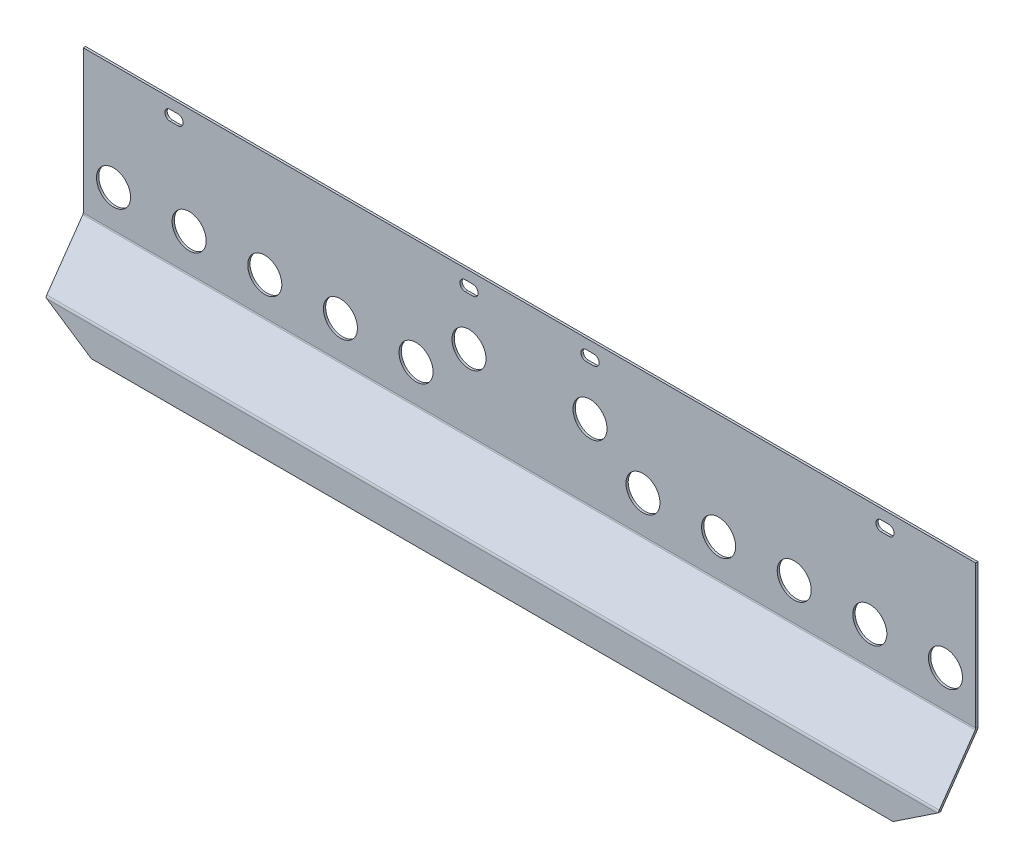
ISO-10303-21;
HEADER;
FILE_DESCRIPTION(('STEP AP214'),'2;1');
FILE_NAME('part.step','',(''),(''),'','','');
FILE_SCHEMA(('AUTOMOTIVE_DESIGN { 1 0 10303 214 1 1 1 1 }'));
ENDSEC;
DATA;
#1=APPLICATION_CONTEXT('core data for automotive mechanical design processes');
#2=APPLICATION_PROTOCOL_DEFINITION('international standard','automotive_design',2000,#1);
#3=PRODUCT_CONTEXT('',#1,'mechanical');
#4=PRODUCT('Part','Part','',(#3));
#5=PRODUCT_RELATED_PRODUCT_CATEGORY('part','',(#4));
#6=PRODUCT_DEFINITION_FORMATION('','',#4);
#7=PRODUCT_DEFINITION_CONTEXT('part definition',#1,'design');
#8=PRODUCT_DEFINITION('design','',#6,#7);
#9=PRODUCT_DEFINITION_SHAPE('','',#8);
#10=(LENGTH_UNIT() NAMED_UNIT(*) SI_UNIT(.MILLI.,.METRE.));
#11=(NAMED_UNIT(*) PLANE_ANGLE_UNIT() SI_UNIT($,.RADIAN.));
#12=(NAMED_UNIT(*) SI_UNIT($,.STERADIAN.) SOLID_ANGLE_UNIT());
#13=UNCERTAINTY_MEASURE_WITH_UNIT(LENGTH_MEASURE(1.E-05),#10,'distance_accuracy_value','');
#14=(GEOMETRIC_REPRESENTATION_CONTEXT(3) GLOBAL_UNCERTAINTY_ASSIGNED_CONTEXT((#13)) GLOBAL_UNIT_ASSIGNED_CONTEXT((#10,
#11,#12)) REPRESENTATION_CONTEXT('',''));
#15=CARTESIAN_POINT('',(0.,0.,0.));
#16=DIRECTION('',(0.,0.,1.));
#17=DIRECTION('',(1.,0.,0.));
#18=AXIS2_PLACEMENT_3D('',#15,#16,#17);
#19=CARTESIAN_POINT('',(295.,21.2748329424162,-0.542543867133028));
#20=DIRECTION('',(1.,0.,0.));
#21=DIRECTION('',(0.,0.,-1.));
#22=AXIS2_PLACEMENT_3D('',#19,#20,#21);
#23=PLANE('',#22);
#24=CARTESIAN_POINT('',(295.,19.554103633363,-3.));
#25=DIRECTION('',(1.,0.,0.));
#26=DIRECTION('',(0.,0.,-1.));
#27=AXIS2_PLACEMENT_3D('',#24,#25,#26);
#28=CIRCLE('',#27,3.);
#29=CARTESIAN_POINT('',(295.,20.,-0.0333223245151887));
#30=VERTEX_POINT('',#29);
#31=CARTESIAN_POINT('',(295.,21.2748329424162,-0.542543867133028));
#32=VERTEX_POINT('',#31);
#33=EDGE_CURVE('E499',#30,#32,#28,.F.);
#34=ORIENTED_EDGE('',*,*,#33,.F.);
#35=DIRECTION('',(0.,0.,-1.));
#36=VECTOR('',#35,1.);
#37=CARTESIAN_POINT('',(295.,20.,-0.542543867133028));
#38=LINE('',#37,#36);
#39=CARTESIAN_POINT('',(295.,20.,-1.56780712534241));
#40=VERTEX_POINT('',#39);
#41=EDGE_CURVE('E671',#30,#40,#38,.T.);
#42=ORIENTED_EDGE('',*,*,#41,.T.);
#43=CARTESIAN_POINT('',(295.,19.554103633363,-3.));
#44=DIRECTION('',(1.,0.,0.));
#45=DIRECTION('',(0.,0.,-1.));
#46=AXIS2_PLACEMENT_3D('',#43,#44,#45);
#47=CIRCLE('',#46,1.5);
#48=CARTESIAN_POINT('',(295.,20.4144682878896,-1.77127193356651));
#49=VERTEX_POINT('',#48);
#50=EDGE_CURVE('E502',#40,#49,#47,.F.);
#51=ORIENTED_EDGE('',*,*,#50,.T.);
#52=DIRECTION('',(0.,-0.573576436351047,-0.819152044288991));
#53=VECTOR('',#52,1.);
#54=CARTESIAN_POINT('',(295.,21.2748329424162,-0.542543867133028));
#55=LINE('',#54,#53);
#56=EDGE_CURVE('E571',#32,#49,#55,.T.);
#57=ORIENTED_EDGE('',*,*,#56,.F.);
#58=EDGE_LOOP('',(#34,#42,#51,#57));
#59=FACE_BOUND('',#58,.T.);
#60=ADVANCED_FACE('F52',(#59),#23,.T.);
#61=CARTESIAN_POINT('',(295.,19.554103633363,-1.5));
#62=DIRECTION('',(1.,0.,0.));
#63=DIRECTION('',(0.,0.,-1.));
#64=AXIS2_PLACEMENT_3D('',#61,#62,#63);
#65=PLANE('',#64);
#66=DIRECTION('',(0.,0.819152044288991,-0.573576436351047));
#67=VECTOR('',#66,1.);
#68=CARTESIAN_POINT('',(295.,20.5,0.));
#69=LINE('',#68,#67);
#70=CARTESIAN_POINT('',(295.,55.3361214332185,-24.3925148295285));
#71=VERTEX_POINT('',#70);
#72=EDGE_CURVE('E495',#32,#71,#69,.T.);
#73=ORIENTED_EDGE('',*,*,#72,.F.);
#74=ORIENTED_EDGE('',*,*,#56,.T.);
#75=DIRECTION('',(0.,0.819152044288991,-0.573576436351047));
#76=VECTOR('',#75,1.);
#77=CARTESIAN_POINT('',(295.,19.6396353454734,-1.22872806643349));
#78=LINE('',#77,#76);
#79=CARTESIAN_POINT('',(295.,54.4757567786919,-25.621242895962));
#80=VERTEX_POINT('',#79);
#81=EDGE_CURVE('E505',#49,#80,#78,.T.);
#82=ORIENTED_EDGE('',*,*,#81,.T.);
#83=DIRECTION('',(0.,0.573576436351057,0.819152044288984));
#84=VECTOR('',#83,1.);
#85=CARTESIAN_POINT('',(295.,54.4757567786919,-25.621242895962));
#86=LINE('',#85,#84);
#87=EDGE_CURVE('E561',#80,#71,#86,.T.);
#88=ORIENTED_EDGE('',*,*,#87,.T.);
#89=EDGE_LOOP('',(#73,#74,#82,#88));
#90=FACE_BOUND('',#89,.T.);
#91=ADVANCED_FACE('F755',(#90),#65,.T.);
#92=CARTESIAN_POINT('',(-295.,19.554103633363,0.));
#93=DIRECTION('',(-1.,0.,0.));
#94=DIRECTION('',(0.,0.,1.));
#95=AXIS2_PLACEMENT_3D('',#92,#93,#94);
#96=PLANE('',#95);
#97=CARTESIAN_POINT('',(-295.,19.554103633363,-3.));
#98=DIRECTION('',(1.,0.,0.));
#99=DIRECTION('',(0.,0.,-1.));
#100=AXIS2_PLACEMENT_3D('',#97,#98,#99);
#101=CIRCLE('',#100,1.5);
#102=CARTESIAN_POINT('',(-295.,20.,-1.56780712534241));
#103=VERTEX_POINT('',#102);
#104=CARTESIAN_POINT('',(-295.,20.4144682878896,-1.77127193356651));
#105=VERTEX_POINT('',#104);
#106=EDGE_CURVE('E469',#103,#105,#101,.F.);
#107=ORIENTED_EDGE('',*,*,#106,.F.);
#108=DIRECTION('',(0.,0.,1.));
#109=VECTOR('',#108,1.);
#110=CARTESIAN_POINT('',(-295.,20.,0.));
#111=LINE('',#110,#109);
#112=CARTESIAN_POINT('',(-295.,20.,-0.0333223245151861));
#113=VERTEX_POINT('',#112);
#114=EDGE_CURVE('E639',#103,#113,#111,.T.);
#115=ORIENTED_EDGE('',*,*,#114,.T.);
#116=CARTESIAN_POINT('',(-295.,19.554103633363,-3.));
#117=DIRECTION('',(1.,0.,0.));
#118=DIRECTION('',(0.,0.,-1.));
#119=AXIS2_PLACEMENT_3D('',#116,#117,#118);
#120=CIRCLE('',#119,3.);
#121=CARTESIAN_POINT('',(-295.,21.2748329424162,-0.542543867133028));
#122=VERTEX_POINT('',#121);
#123=EDGE_CURVE('E466',#113,#122,#120,.F.);
#124=ORIENTED_EDGE('',*,*,#123,.T.);
#125=DIRECTION('',(0.,0.573576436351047,0.819152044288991));
#126=VECTOR('',#125,1.);
#127=CARTESIAN_POINT('',(-295.,20.4144682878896,-1.77127193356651));
#128=LINE('',#127,#126);
#129=EDGE_CURVE('E567',#105,#122,#128,.T.);
#130=ORIENTED_EDGE('',*,*,#129,.F.);
#131=EDGE_LOOP('',(#107,#115,#124,#130));
#132=FACE_BOUND('',#131,.T.);
#133=ADVANCED_FACE('F761',(#132),#96,.T.);
#134=CARTESIAN_POINT('',(295.,56.1964860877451,-24.663786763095));
#135=DIRECTION('',(1.,0.,0.));
#136=DIRECTION('',(0.,0.,-1.));
#137=AXIS2_PLACEMENT_3D('',#134,#135,#136);
#138=PLANE('',#137);
#139=DIRECTION('',(0.,0.,-1.));
#140=VECTOR('',#139,1.);
#141=CARTESIAN_POINT('',(295.,56.1964860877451,-24.663786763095));
#142=LINE('',#141,#140);
#143=CARTESIAN_POINT('',(295.,56.1964860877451,-24.663786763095));
#144=VERTEX_POINT('',#143);
#145=CARTESIAN_POINT('',(295.,56.1964860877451,-26.163786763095));
#146=VERTEX_POINT('',#145);
#147=EDGE_CURVE('E564',#144,#146,#142,.T.);
#148=ORIENTED_EDGE('',*,*,#147,.F.);
#149=CARTESIAN_POINT('',(295.,56.1964860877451,-23.163786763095));
#150=DIRECTION('',(-1.,0.,0.));
#151=DIRECTION('',(0.,0.,1.));
#152=AXIS2_PLACEMENT_3D('',#149,#150,#151);
#153=CIRCLE('',#152,1.5);
#154=EDGE_CURVE('E491',#71,#144,#153,.F.);
#155=ORIENTED_EDGE('',*,*,#154,.F.);
#156=ORIENTED_EDGE('',*,*,#87,.F.);
#157=CARTESIAN_POINT('',(295.,56.1964860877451,-23.163786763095));
#158=DIRECTION('',(1.,0.,0.));
#159=DIRECTION('',(0.,0.,-1.));
#160=AXIS2_PLACEMENT_3D('',#157,#158,#159);
#161=CIRCLE('',#160,3.);
#162=EDGE_CURVE('E509',#80,#146,#161,.T.);
#163=ORIENTED_EDGE('',*,*,#162,.T.);
#164=EDGE_LOOP('',(#148,#155,#156,#163));
#165=FACE_BOUND('',#164,.T.);
#166=ADVANCED_FACE('F826',(#165),#138,.T.);
#167=CARTESIAN_POINT('',(295.,54.4757567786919,-25.621242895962));
#168=DIRECTION('',(1.,0.,0.));
#169=DIRECTION('',(0.,0.,-1.));
#170=AXIS2_PLACEMENT_3D('',#167,#168,#169);
#171=PLANE('',#170);
#172=DIRECTION('',(0.,1.,0.));
#173=VECTOR('',#172,1.);
#174=CARTESIAN_POINT('',(295.,55.7235379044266,-24.663786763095));
#175=LINE('',#174,#173);
#176=CARTESIAN_POINT('',(295.,150.723537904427,-24.663786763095));
#177=VERTEX_POINT('',#176);
#178=EDGE_CURVE('E487',#144,#177,#175,.T.);
#179=ORIENTED_EDGE('',*,*,#178,.F.);
#180=ORIENTED_EDGE('',*,*,#147,.T.);
#181=DIRECTION('',(0.,1.,0.));
#182=VECTOR('',#181,1.);
#183=CARTESIAN_POINT('',(295.,55.7235379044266,-26.163786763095));
#184=LINE('',#183,#182);
#185=CARTESIAN_POINT('',(295.,150.723537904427,-26.163786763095));
#186=VERTEX_POINT('',#185);
#187=EDGE_CURVE('E480',#146,#186,#184,.T.);
#188=ORIENTED_EDGE('',*,*,#187,.T.);
#189=DIRECTION('',(0.,0.,-1.));
#190=VECTOR('',#189,1.);
#191=CARTESIAN_POINT('',(295.,150.723537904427,-24.663786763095));
#192=LINE('',#191,#190);
#193=EDGE_CURVE('E483',#177,#186,#192,.T.);
#194=ORIENTED_EDGE('',*,*,#193,.F.);
#195=EDGE_LOOP('',(#179,#180,#188,#194));
#196=FACE_BOUND('',#195,.T.);
#197=ADVANCED_FACE('F822',(#196),#171,.T.);
#198=CARTESIAN_POINT('',(-295.,55.3361214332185,-24.3925148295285));
#199=DIRECTION('',(-1.,0.,0.));
#200=DIRECTION('',(0.,0.,1.));
#201=AXIS2_PLACEMENT_3D('',#198,#199,#200);
#202=PLANE('',#201);
#203=DIRECTION('',(0.,-0.573576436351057,-0.819152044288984));
#204=VECTOR('',#203,1.);
#205=CARTESIAN_POINT('',(-295.,55.3361214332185,-24.3925148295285));
#206=LINE('',#205,#204);
#207=CARTESIAN_POINT('',(-295.,55.3361214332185,-24.3925148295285));
#208=VERTEX_POINT('',#207);
#209=CARTESIAN_POINT('',(-295.,54.4757567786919,-25.621242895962));
#210=VERTEX_POINT('',#209);
#211=EDGE_CURVE('E558',#208,#210,#206,.T.);
#212=ORIENTED_EDGE('',*,*,#211,.F.);
#213=CARTESIAN_POINT('',(-295.,56.1964860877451,-23.163786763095));
#214=DIRECTION('',(-1.,0.,0.));
#215=DIRECTION('',(0.,0.,1.));
#216=AXIS2_PLACEMENT_3D('',#213,#214,#215);
#217=CIRCLE('',#216,1.5);
#218=CARTESIAN_POINT('',(-295.,56.1964860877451,-24.663786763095));
#219=VERTEX_POINT('',#218);
#220=EDGE_CURVE('E458',#208,#219,#217,.F.);
#221=ORIENTED_EDGE('',*,*,#220,.T.);
#222=DIRECTION('',(0.,0.,1.));
#223=VECTOR('',#222,1.);
#224=CARTESIAN_POINT('',(-295.,56.1964860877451,-26.163786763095));
#225=LINE('',#224,#223);
#226=CARTESIAN_POINT('',(-295.,56.1964860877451,-26.163786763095));
#227=VERTEX_POINT('',#226);
#228=EDGE_CURVE('E555',#227,#219,#225,.T.);
#229=ORIENTED_EDGE('',*,*,#228,.F.);
#230=CARTESIAN_POINT('',(-295.,56.1964860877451,-23.163786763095));
#231=DIRECTION('',(1.,0.,0.));
#232=DIRECTION('',(0.,0.,-1.));
#233=AXIS2_PLACEMENT_3D('',#230,#231,#232);
#234=CIRCLE('',#233,3.);
#235=EDGE_CURVE('E476',#210,#227,#234,.T.);
#236=ORIENTED_EDGE('',*,*,#235,.F.);
#237=EDGE_LOOP('',(#212,#221,#229,#236));
#238=FACE_BOUND('',#237,.T.);
#239=ADVANCED_FACE('F818',(#238),#202,.T.);
#240=CARTESIAN_POINT('',(-295.,56.1964860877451,-26.163786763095));
#241=DIRECTION('',(-1.,0.,0.));
#242=DIRECTION('',(0.,0.,1.));
#243=AXIS2_PLACEMENT_3D('',#240,#241,#242);
#244=PLANE('',#243);
#245=DIRECTION('',(0.,0.819152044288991,-0.573576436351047));
#246=VECTOR('',#245,1.);
#247=CARTESIAN_POINT('',(-295.,20.5,0.));
#248=LINE('',#247,#246);
#249=EDGE_CURVE('E462',#122,#208,#248,.T.);
#250=ORIENTED_EDGE('',*,*,#249,.T.);
#251=ORIENTED_EDGE('',*,*,#211,.T.);
#252=DIRECTION('',(0.,0.819152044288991,-0.573576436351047));
#253=VECTOR('',#252,1.);
#254=CARTESIAN_POINT('',(-295.,19.6396353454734,-1.22872806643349));
#255=LINE('',#254,#253);
#256=EDGE_CURVE('E472',#105,#210,#255,.T.);
#257=ORIENTED_EDGE('',*,*,#256,.F.);
#258=ORIENTED_EDGE('',*,*,#129,.T.);
#259=EDGE_LOOP('',(#250,#251,#257,#258));
#260=FACE_BOUND('',#259,.T.);
#261=ADVANCED_FACE('F700',(#260),#244,.T.);
#262=CARTESIAN_POINT('',(295.,55.7235379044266,-26.163786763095));
#263=DIRECTION('',(0.,0.,1.));
#264=DIRECTION('',(0.,-1.,0.));
#265=AXIS2_PLACEMENT_3D('',#262,#263,#264);
#266=PLANE('',#265);
#267=CARTESIAN_POINT('',(40.,105.723537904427,-26.163786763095));
#268=DIRECTION('',(0.,0.,-1.));
#269=DIRECTION('',(0.,1.,0.));
#270=AXIS2_PLACEMENT_3D('',#267,#268,#269);
#271=CIRCLE('',#270,11.25);
#272=CARTESIAN_POINT('',(40.,116.973537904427,-26.163786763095));
#273=VERTEX_POINT('',#272);
#274=EDGE_CURVE('E688',#273,#273,#271,.T.);
#275=ORIENTED_EDGE('',*,*,#274,.F.);
#276=EDGE_LOOP('',(#275));
#277=FACE_BOUND('',#276,.T.);
#278=CARTESIAN_POINT('',(-40.,105.723537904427,-26.163786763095));
#279=DIRECTION('',(0.,0.,-1.));
#280=DIRECTION('',(0.,1.,0.));
#281=AXIS2_PLACEMENT_3D('',#278,#279,#280);
#282=CIRCLE('',#281,11.25);
#283=CARTESIAN_POINT('',(-40.,116.973537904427,-26.163786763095));
#284=VERTEX_POINT('',#283);
#285=EDGE_CURVE('E678',#284,#284,#282,.T.);
#286=ORIENTED_EDGE('',*,*,#285,.F.);
#287=EDGE_LOOP('',(#286));
#288=FACE_BOUND('',#287,.T.);
#289=DIRECTION('',(1.,0.,0.));
#290=VECTOR('',#289,1.);
#291=CARTESIAN_POINT('',(-237.6,144.123537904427,-26.163786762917));
#292=LINE('',#291,#290);
#293=CARTESIAN_POINT('',(-237.6,144.123537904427,-26.163786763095));
#294=VERTEX_POINT('',#293);
#295=CARTESIAN_POINT('',(-232.4,144.123537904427,-26.163786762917));
#296=VERTEX_POINT('',#295);
#297=EDGE_CURVE('E276',#294,#296,#292,.T.);
#298=ORIENTED_EDGE('',*,*,#297,.F.);
#299=CARTESIAN_POINT('',(-237.6,140.723537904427,-26.163786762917));
#300=DIRECTION('',(0.,0.,-1.));
#301=DIRECTION('',(-1.,0.,0.));
#302=AXIS2_PLACEMENT_3D('',#299,#300,#301);
#303=CIRCLE('',#302,3.39999999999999);
#304=CARTESIAN_POINT('',(-237.6,137.323537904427,-26.163786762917));
#305=VERTEX_POINT('',#304);
#306=EDGE_CURVE('E70',#305,#294,#303,.T.);
#307=ORIENTED_EDGE('',*,*,#306,.F.);
#308=DIRECTION('',(-1.,0.,0.));
#309=VECTOR('',#308,1.);
#310=CARTESIAN_POINT('',(-232.4,137.323537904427,-26.163786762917));
#311=LINE('',#310,#309);
#312=CARTESIAN_POINT('',(-232.4,137.323537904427,-26.163786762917));
#313=VERTEX_POINT('',#312);
#314=EDGE_CURVE('E265',#313,#305,#311,.T.);
#315=ORIENTED_EDGE('',*,*,#314,.F.);
#316=CARTESIAN_POINT('',(-232.4,140.723537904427,-26.163786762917));
#317=DIRECTION('',(0.,0.,-1.));
#318=DIRECTION('',(-1.,0.,0.));
#319=AXIS2_PLACEMENT_3D('',#316,#317,#318);
#320=CIRCLE('',#319,3.39999999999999);
#321=EDGE_CURVE('E285',#296,#313,#320,.T.);
#322=ORIENTED_EDGE('',*,*,#321,.F.);
#323=EDGE_LOOP('',(#298,#307,#315,#322));
#324=FACE_BOUND('',#323,.T.);
#325=DIRECTION('',(1.,0.,0.));
#326=VECTOR('',#325,1.);
#327=CARTESIAN_POINT('',(37.4,144.123537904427,-26.163786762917));
#328=LINE('',#327,#326);
#329=CARTESIAN_POINT('',(37.4,144.123537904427,-26.163786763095));
#330=VERTEX_POINT('',#329);
#331=CARTESIAN_POINT('',(42.6,144.123537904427,-26.163786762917));
#332=VERTEX_POINT('',#331);
#333=EDGE_CURVE('E313',#330,#332,#328,.T.);
#334=ORIENTED_EDGE('',*,*,#333,.F.);
#335=CARTESIAN_POINT('',(37.4,140.723537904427,-26.163786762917));
#336=DIRECTION('',(0.,0.,-1.));
#337=DIRECTION('',(-1.,0.,0.));
#338=AXIS2_PLACEMENT_3D('',#335,#336,#337);
#339=CIRCLE('',#338,3.39999999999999);
#340=CARTESIAN_POINT('',(37.4,137.323537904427,-26.163786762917));
#341=VERTEX_POINT('',#340);
#342=EDGE_CURVE('E310',#341,#330,#339,.T.);
#343=ORIENTED_EDGE('',*,*,#342,.F.);
#344=DIRECTION('',(-1.,0.,0.));
#345=VECTOR('',#344,1.);
#346=CARTESIAN_POINT('',(42.6,137.323537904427,-26.163786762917));
#347=LINE('',#346,#345);
#348=CARTESIAN_POINT('',(42.6,137.323537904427,-26.163786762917));
#349=VERTEX_POINT('',#348);
#350=EDGE_CURVE('E321',#349,#341,#347,.T.);
#351=ORIENTED_EDGE('',*,*,#350,.F.);
#352=CARTESIAN_POINT('',(42.6,140.723537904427,-26.163786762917));
#353=DIRECTION('',(0.,0.,-1.));
#354=DIRECTION('',(-1.,0.,0.));
#355=AXIS2_PLACEMENT_3D('',#352,#353,#354);
#356=CIRCLE('',#355,3.39999999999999);
#357=EDGE_CURVE('E317',#332,#349,#356,.T.);
#358=ORIENTED_EDGE('',*,*,#357,.F.);
#359=EDGE_LOOP('',(#334,#343,#351,#358));
#360=FACE_BOUND('',#359,.T.);
#361=DIRECTION('',(1.,0.,0.));
#362=VECTOR('',#361,1.);
#363=CARTESIAN_POINT('',(-42.6,144.123537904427,-26.163786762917));
#364=LINE('',#363,#362);
#365=CARTESIAN_POINT('',(-42.6,144.123537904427,-26.163786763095));
#366=VERTEX_POINT('',#365);
#367=CARTESIAN_POINT('',(-37.4,144.123537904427,-26.163786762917));
#368=VERTEX_POINT('',#367);
#369=EDGE_CURVE('E357',#366,#368,#364,.T.);
#370=ORIENTED_EDGE('',*,*,#369,.F.);
#371=CARTESIAN_POINT('',(-42.6,140.723537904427,-26.163786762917));
#372=DIRECTION('',(0.,0.,-1.));
#373=DIRECTION('',(-1.,0.,0.));
#374=AXIS2_PLACEMENT_3D('',#371,#372,#373);
#375=CIRCLE('',#374,3.39999999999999);
#376=CARTESIAN_POINT('',(-42.6,137.323537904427,-26.163786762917));
#377=VERTEX_POINT('',#376);
#378=EDGE_CURVE('E354',#377,#366,#375,.T.);
#379=ORIENTED_EDGE('',*,*,#378,.F.);
#380=DIRECTION('',(-1.,0.,0.));
#381=VECTOR('',#380,1.);
#382=CARTESIAN_POINT('',(-37.4,137.323537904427,-26.163786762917));
#383=LINE('',#382,#381);
#384=CARTESIAN_POINT('',(-37.4,137.323537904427,-26.163786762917));
#385=VERTEX_POINT('',#384);
#386=EDGE_CURVE('E365',#385,#377,#383,.T.);
#387=ORIENTED_EDGE('',*,*,#386,.F.);
#388=CARTESIAN_POINT('',(-37.4,140.723537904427,-26.163786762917));
#389=DIRECTION('',(0.,0.,-1.));
#390=DIRECTION('',(-1.,0.,0.));
#391=AXIS2_PLACEMENT_3D('',#388,#389,#390);
#392=CIRCLE('',#391,3.39999999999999);
#393=EDGE_CURVE('E361',#368,#385,#392,.T.);
#394=ORIENTED_EDGE('',*,*,#393,.F.);
#395=EDGE_LOOP('',(#370,#379,#387,#394));
#396=FACE_BOUND('',#395,.T.);
#397=CARTESIAN_POINT('',(225.,80.7235379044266,-26.163786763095));
#398=DIRECTION('',(0.,0.,-1.));
#399=DIRECTION('',(-1.,0.,0.));
#400=AXIS2_PLACEMENT_3D('',#397,#398,#399);
#401=CIRCLE('',#400,11.25);
#402=CARTESIAN_POINT('',(213.75,80.7235379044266,-26.163786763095));
#403=VERTEX_POINT('',#402);
#404=EDGE_CURVE('E390',#403,#403,#401,.T.);
#405=ORIENTED_EDGE('',*,*,#404,.F.);
#406=EDGE_LOOP('',(#405));
#407=FACE_BOUND('',#406,.T.);
#408=CARTESIAN_POINT('',(275.,80.7235379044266,-26.163786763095));
#409=DIRECTION('',(0.,0.,-1.));
#410=DIRECTION('',(-1.,0.,0.));
#411=AXIS2_PLACEMENT_3D('',#408,#409,#410);
#412=CIRCLE('',#411,11.25);
#413=CARTESIAN_POINT('',(263.75,80.7235379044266,-26.163786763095));
#414=VERTEX_POINT('',#413);
#415=EDGE_CURVE('E395',#414,#414,#412,.T.);
#416=ORIENTED_EDGE('',*,*,#415,.F.);
#417=EDGE_LOOP('',(#416));
#418=FACE_BOUND('',#417,.T.);
#419=DIRECTION('',(1.,0.,0.));
#420=VECTOR('',#419,1.);
#421=CARTESIAN_POINT('',(232.4,144.123537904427,-26.163786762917));
#422=LINE('',#421,#420);
#423=CARTESIAN_POINT('',(232.4,144.123537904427,-26.163786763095));
#424=VERTEX_POINT('',#423);
#425=CARTESIAN_POINT('',(237.6,144.123537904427,-26.163786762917));
#426=VERTEX_POINT('',#425);
#427=EDGE_CURVE('E417',#424,#426,#422,.T.);
#428=ORIENTED_EDGE('',*,*,#427,.F.);
#429=CARTESIAN_POINT('',(232.4,140.723537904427,-26.163786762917));
#430=DIRECTION('',(0.,0.,-1.));
#431=DIRECTION('',(-1.,0.,0.));
#432=AXIS2_PLACEMENT_3D('',#429,#430,#431);
#433=CIRCLE('',#432,3.39999999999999);
#434=CARTESIAN_POINT('',(232.4,137.323537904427,-26.163786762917));
#435=VERTEX_POINT('',#434);
#436=EDGE_CURVE('E414',#435,#424,#433,.T.);
#437=ORIENTED_EDGE('',*,*,#436,.F.);
#438=DIRECTION('',(-1.,0.,0.));
#439=VECTOR('',#438,1.);
#440=CARTESIAN_POINT('',(237.6,137.323537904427,-26.163786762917));
#441=LINE('',#440,#439);
#442=CARTESIAN_POINT('',(237.6,137.323537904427,-26.163786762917));
#443=VERTEX_POINT('',#442);
#444=EDGE_CURVE('E425',#443,#435,#441,.T.);
#445=ORIENTED_EDGE('',*,*,#444,.F.);
#446=CARTESIAN_POINT('',(237.6,140.723537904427,-26.163786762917));
#447=DIRECTION('',(0.,0.,-1.));
#448=DIRECTION('',(-1.,0.,0.));
#449=AXIS2_PLACEMENT_3D('',#446,#447,#448);
#450=CIRCLE('',#449,3.39999999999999);
#451=EDGE_CURVE('E421',#426,#443,#450,.T.);
#452=ORIENTED_EDGE('',*,*,#451,.F.);
#453=EDGE_LOOP('',(#428,#437,#445,#452));
#454=FACE_BOUND('',#453,.T.);
#455=DIRECTION('',(0.,1.,0.));
#456=VECTOR('',#455,1.);
#457=CARTESIAN_POINT('',(-295.,55.7235379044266,-26.163786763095));
#458=LINE('',#457,#456);
#459=CARTESIAN_POINT('',(-295.,150.723537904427,-26.163786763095));
#460=VERTEX_POINT('',#459);
#461=EDGE_CURVE('E446',#227,#460,#458,.T.);
#462=ORIENTED_EDGE('',*,*,#461,.T.);
#463=DIRECTION('',(-1.,0.,0.));
#464=VECTOR('',#463,1.);
#465=CARTESIAN_POINT('',(295.,150.723537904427,-26.163786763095));
#466=LINE('',#465,#464);
#467=EDGE_CURVE('E552',#186,#460,#466,.T.);
#468=ORIENTED_EDGE('',*,*,#467,.F.);
#469=ORIENTED_EDGE('',*,*,#187,.F.);
#470=DIRECTION('',(-1.,0.,0.));
#471=VECTOR('',#470,1.);
#472=CARTESIAN_POINT('',(295.,56.1964860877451,-26.163786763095));
#473=LINE('',#472,#471);
#474=EDGE_CURVE('E513',#146,#227,#473,.T.);
#475=ORIENTED_EDGE('',*,*,#474,.T.);
#476=EDGE_LOOP('',(#462,#468,#469,#475));
#477=FACE_BOUND('',#476,.T.);
#478=CARTESIAN_POINT('',(175.,80.7235379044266,-26.163786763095));
#479=DIRECTION('',(0.,0.,-1.));
#480=DIRECTION('',(-1.,0.,0.));
#481=AXIS2_PLACEMENT_3D('',#478,#479,#480);
#482=CIRCLE('',#481,11.25);
#483=CARTESIAN_POINT('',(163.75,80.7235379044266,-26.163786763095));
#484=VERTEX_POINT('',#483);
#485=EDGE_CURVE('E579',#484,#484,#482,.T.);
#486=ORIENTED_EDGE('',*,*,#485,.F.);
#487=EDGE_LOOP('',(#486));
#488=FACE_BOUND('',#487,.T.);
#489=CARTESIAN_POINT('',(125.,80.7235379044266,-26.163786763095));
#490=DIRECTION('',(0.,0.,-1.));
#491=DIRECTION('',(-1.,0.,0.));
#492=AXIS2_PLACEMENT_3D('',#489,#490,#491);
#493=CIRCLE('',#492,11.25);
#494=CARTESIAN_POINT('',(113.75,80.7235379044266,-26.163786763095));
#495=VERTEX_POINT('',#494);
#496=EDGE_CURVE('E587',#495,#495,#493,.T.);
#497=ORIENTED_EDGE('',*,*,#496,.F.);
#498=EDGE_LOOP('',(#497));
#499=FACE_BOUND('',#498,.T.);
#500=CARTESIAN_POINT('',(75.,80.7235379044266,-26.163786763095));
#501=DIRECTION('',(0.,0.,-1.));
#502=DIRECTION('',(-1.,0.,0.));
#503=AXIS2_PLACEMENT_3D('',#500,#501,#502);
#504=CIRCLE('',#503,11.25);
#505=CARTESIAN_POINT('',(63.75,80.7235379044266,-26.163786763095));
#506=VERTEX_POINT('',#505);
#507=EDGE_CURVE('E595',#506,#506,#504,.T.);
#508=ORIENTED_EDGE('',*,*,#507,.F.);
#509=EDGE_LOOP('',(#508));
#510=FACE_BOUND('',#509,.T.);
#511=CARTESIAN_POINT('',(-75.0000000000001,80.7235379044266,-26.163786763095));
#512=DIRECTION('',(0.,0.,-1.));
#513=DIRECTION('',(-1.,0.,0.));
#514=AXIS2_PLACEMENT_3D('',#511,#512,#513);
#515=CIRCLE('',#514,11.25);
#516=CARTESIAN_POINT('',(-86.2500000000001,80.7235379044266,-26.163786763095));
#517=VERTEX_POINT('',#516);
#518=EDGE_CURVE('E603',#517,#517,#515,.T.);
#519=ORIENTED_EDGE('',*,*,#518,.F.);
#520=EDGE_LOOP('',(#519));
#521=FACE_BOUND('',#520,.T.);
#522=CARTESIAN_POINT('',(-125.,80.7235379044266,-26.163786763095));
#523=DIRECTION('',(0.,0.,-1.));
#524=DIRECTION('',(-1.,0.,0.));
#525=AXIS2_PLACEMENT_3D('',#522,#523,#524);
#526=CIRCLE('',#525,11.25);
#527=CARTESIAN_POINT('',(-136.25,80.7235379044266,-26.163786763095));
#528=VERTEX_POINT('',#527);
#529=EDGE_CURVE('E611',#528,#528,#526,.T.);
#530=ORIENTED_EDGE('',*,*,#529,.F.);
#531=EDGE_LOOP('',(#530));
#532=FACE_BOUND('',#531,.T.);
#533=CARTESIAN_POINT('',(-175.,80.7235379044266,-26.163786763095));
#534=DIRECTION('',(0.,0.,-1.));
#535=DIRECTION('',(-1.,0.,0.));
#536=AXIS2_PLACEMENT_3D('',#533,#534,#535);
#537=CIRCLE('',#536,11.25);
#538=CARTESIAN_POINT('',(-186.25,80.7235379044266,-26.163786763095));
#539=VERTEX_POINT('',#538);
#540=EDGE_CURVE('E619',#539,#539,#537,.T.);
#541=ORIENTED_EDGE('',*,*,#540,.F.);
#542=EDGE_LOOP('',(#541));
#543=FACE_BOUND('',#542,.T.);
#544=CARTESIAN_POINT('',(-225.,80.7235379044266,-26.163786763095));
#545=DIRECTION('',(0.,0.,-1.));
#546=DIRECTION('',(-1.,0.,0.));
#547=AXIS2_PLACEMENT_3D('',#544,#545,#546);
#548=CIRCLE('',#547,11.25);
#549=CARTESIAN_POINT('',(-236.25,80.7235379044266,-26.163786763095));
#550=VERTEX_POINT('',#549);
#551=EDGE_CURVE('E627',#550,#550,#548,.T.);
#552=ORIENTED_EDGE('',*,*,#551,.F.);
#553=EDGE_LOOP('',(#552));
#554=FACE_BOUND('',#553,.T.);
#555=CARTESIAN_POINT('',(-275.,80.7235379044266,-26.163786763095));
#556=DIRECTION('',(0.,0.,-1.));
#557=DIRECTION('',(-1.,0.,0.));
#558=AXIS2_PLACEMENT_3D('',#555,#556,#557);
#559=CIRCLE('',#558,11.25);
#560=CARTESIAN_POINT('',(-286.25,80.7235379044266,-26.163786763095));
#561=VERTEX_POINT('',#560);
#562=EDGE_CURVE('E635',#561,#561,#559,.T.);
#563=ORIENTED_EDGE('',*,*,#562,.F.);
#564=EDGE_LOOP('',(#563));
#565=FACE_BOUND('',#564,.T.);
#566=ADVANCED_FACE('F696',(#277,#288,#324,#360,#396,#407,#418,#454,#477,#488,#499,#510,#521,
#532,#543,#554,#565),#266,.F.);
#567=CARTESIAN_POINT('',(295.,150.723537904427,-24.663786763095));
#568=DIRECTION('',(0.,1.,0.));
#569=DIRECTION('',(0.,0.,1.));
#570=AXIS2_PLACEMENT_3D('',#567,#568,#569);
#571=PLANE('',#570);
#572=DIRECTION('',(0.,0.,-1.));
#573=VECTOR('',#572,1.);
#574=CARTESIAN_POINT('',(-295.,150.723537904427,-24.663786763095));
#575=LINE('',#574,#573);
#576=CARTESIAN_POINT('',(-295.,150.723537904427,-24.663786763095));
#577=VERTEX_POINT('',#576);
#578=EDGE_CURVE('E450',#577,#460,#575,.T.);
#579=ORIENTED_EDGE('',*,*,#578,.F.);
#580=DIRECTION('',(-1.,0.,0.));
#581=VECTOR('',#580,1.);
#582=CARTESIAN_POINT('',(295.,150.723537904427,-24.663786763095));
#583=LINE('',#582,#581);
#584=EDGE_CURVE('E549',#177,#577,#583,.T.);
#585=ORIENTED_EDGE('',*,*,#584,.F.);
#586=ORIENTED_EDGE('',*,*,#193,.T.);
#587=ORIENTED_EDGE('',*,*,#467,.T.);
#588=EDGE_LOOP('',(#579,#585,#586,#587));
#589=FACE_BOUND('',#588,.T.);
#590=ADVANCED_FACE('F699',(#589),#571,.T.);
#591=CARTESIAN_POINT('',(295.,55.7235379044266,-24.663786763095));
#592=DIRECTION('',(0.,0.,1.));
#593=DIRECTION('',(0.,-1.,0.));
#594=AXIS2_PLACEMENT_3D('',#591,#592,#593);
#595=PLANE('',#594);
#596=CARTESIAN_POINT('',(40.,105.723537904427,-24.663786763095));
#597=DIRECTION('',(0.,0.,1.));
#598=DIRECTION('',(0.,-1.,0.));
#599=AXIS2_PLACEMENT_3D('',#596,#597,#598);
#600=CIRCLE('',#599,11.25);
#601=CARTESIAN_POINT('',(40.,94.4735379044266,-24.663786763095));
#602=VERTEX_POINT('',#601);
#603=EDGE_CURVE('E56',#602,#602,#600,.T.);
#604=ORIENTED_EDGE('',*,*,#603,.F.);
#605=EDGE_LOOP('',(#604));
#606=FACE_BOUND('',#605,.T.);
#607=CARTESIAN_POINT('',(-40.,105.723537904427,-24.663786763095));
#608=DIRECTION('',(0.,0.,1.));
#609=DIRECTION('',(0.,-1.,0.));
#610=AXIS2_PLACEMENT_3D('',#607,#608,#609);
#611=CIRCLE('',#610,11.25);
#612=CARTESIAN_POINT('',(-40.,94.4735379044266,-24.663786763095));
#613=VERTEX_POINT('',#612);
#614=EDGE_CURVE('E675',#613,#613,#611,.T.);
#615=ORIENTED_EDGE('',*,*,#614,.F.);
#616=EDGE_LOOP('',(#615));
#617=FACE_BOUND('',#616,.T.);
#618=CARTESIAN_POINT('',(-237.6,140.723537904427,-24.663786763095));
#619=DIRECTION('',(0.,0.,1.));
#620=DIRECTION('',(0.,-1.,0.));
#621=AXIS2_PLACEMENT_3D('',#618,#619,#620);
#622=CIRCLE('',#621,3.39999999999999);
#623=CARTESIAN_POINT('',(-237.6,137.323537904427,-24.663786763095));
#624=VERTEX_POINT('',#623);
#625=CARTESIAN_POINT('',(-237.6,144.123537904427,-24.663786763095));
#626=VERTEX_POINT('',#625);
#627=EDGE_CURVE('E262',#624,#626,#622,.F.);
#628=ORIENTED_EDGE('',*,*,#627,.T.);
#629=DIRECTION('',(1.,0.,0.));
#630=VECTOR('',#629,1.);
#631=CARTESIAN_POINT('',(-237.6,144.123537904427,-24.663786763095));
#632=LINE('',#631,#630);
#633=CARTESIAN_POINT('',(-232.4,144.123537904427,-24.663786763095));
#634=VERTEX_POINT('',#633);
#635=EDGE_CURVE('E250',#626,#634,#632,.T.);
#636=ORIENTED_EDGE('',*,*,#635,.T.);
#637=CARTESIAN_POINT('',(-232.4,140.723537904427,-24.663786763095));
#638=DIRECTION('',(0.,0.,1.));
#639=DIRECTION('',(0.,-1.,0.));
#640=AXIS2_PLACEMENT_3D('',#637,#638,#639);
#641=CIRCLE('',#640,3.39999999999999);
#642=CARTESIAN_POINT('',(-232.4,137.323537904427,-24.663786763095));
#643=VERTEX_POINT('',#642);
#644=EDGE_CURVE('E279',#634,#643,#641,.F.);
#645=ORIENTED_EDGE('',*,*,#644,.T.);
#646=DIRECTION('',(-1.,0.,0.));
#647=VECTOR('',#646,1.);
#648=CARTESIAN_POINT('',(-232.4,137.323537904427,-24.663786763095));
#649=LINE('',#648,#647);
#650=EDGE_CURVE('E270',#643,#624,#649,.T.);
#651=ORIENTED_EDGE('',*,*,#650,.T.);
#652=EDGE_LOOP('',(#628,#636,#645,#651));
#653=FACE_BOUND('',#652,.T.);
#654=CARTESIAN_POINT('',(37.4,140.723537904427,-24.663786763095));
#655=DIRECTION('',(0.,0.,1.));
#656=DIRECTION('',(0.,-1.,0.));
#657=AXIS2_PLACEMENT_3D('',#654,#655,#656);
#658=CIRCLE('',#657,3.39999999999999);
#659=CARTESIAN_POINT('',(37.4,137.323537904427,-24.663786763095));
#660=VERTEX_POINT('',#659);
#661=CARTESIAN_POINT('',(37.4,144.123537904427,-24.663786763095));
#662=VERTEX_POINT('',#661);
#663=EDGE_CURVE('E306',#660,#662,#658,.F.);
#664=ORIENTED_EDGE('',*,*,#663,.T.);
#665=DIRECTION('',(1.,0.,0.));
#666=VECTOR('',#665,1.);
#667=CARTESIAN_POINT('',(37.4,144.123537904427,-24.663786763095));
#668=LINE('',#667,#666);
#669=CARTESIAN_POINT('',(42.6,144.123537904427,-24.663786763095));
#670=VERTEX_POINT('',#669);
#671=EDGE_CURVE('E329',#662,#670,#668,.T.);
#672=ORIENTED_EDGE('',*,*,#671,.T.);
#673=CARTESIAN_POINT('',(42.6,140.723537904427,-24.663786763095));
#674=DIRECTION('',(0.,0.,1.));
#675=DIRECTION('',(0.,-1.,0.));
#676=AXIS2_PLACEMENT_3D('',#673,#674,#675);
#677=CIRCLE('',#676,3.39999999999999);
#678=CARTESIAN_POINT('',(42.6,137.323537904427,-24.663786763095));
#679=VERTEX_POINT('',#678);
#680=EDGE_CURVE('E258',#670,#679,#677,.F.);
#681=ORIENTED_EDGE('',*,*,#680,.T.);
#682=DIRECTION('',(-1.,0.,0.));
#683=VECTOR('',#682,1.);
#684=CARTESIAN_POINT('',(42.6,137.323537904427,-24.663786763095));
#685=LINE('',#684,#683);
#686=EDGE_CURVE('E302',#679,#660,#685,.T.);
#687=ORIENTED_EDGE('',*,*,#686,.T.);
#688=EDGE_LOOP('',(#664,#672,#681,#687));
#689=FACE_BOUND('',#688,.T.);
#690=CARTESIAN_POINT('',(-42.6,140.723537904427,-24.663786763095));
#691=DIRECTION('',(0.,0.,1.));
#692=DIRECTION('',(0.,-1.,0.));
#693=AXIS2_PLACEMENT_3D('',#690,#691,#692);
#694=CIRCLE('',#693,3.39999999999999);
#695=CARTESIAN_POINT('',(-42.6,137.323537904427,-24.663786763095));
#696=VERTEX_POINT('',#695);
#697=CARTESIAN_POINT('',(-42.6,144.123537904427,-24.663786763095));
#698=VERTEX_POINT('',#697);
#699=EDGE_CURVE('E350',#696,#698,#694,.F.);
#700=ORIENTED_EDGE('',*,*,#699,.T.);
#701=DIRECTION('',(1.,0.,0.));
#702=VECTOR('',#701,1.);
#703=CARTESIAN_POINT('',(-42.6,144.123537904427,-24.663786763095));
#704=LINE('',#703,#702);
#705=CARTESIAN_POINT('',(-37.4,144.123537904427,-24.663786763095));
#706=VERTEX_POINT('',#705);
#707=EDGE_CURVE('E373',#698,#706,#704,.T.);
#708=ORIENTED_EDGE('',*,*,#707,.T.);
#709=CARTESIAN_POINT('',(-37.4,140.723537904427,-24.663786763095));
#710=DIRECTION('',(0.,0.,1.));
#711=DIRECTION('',(0.,-1.,0.));
#712=AXIS2_PLACEMENT_3D('',#709,#710,#711);
#713=CIRCLE('',#712,3.39999999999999);
#714=CARTESIAN_POINT('',(-37.4,137.323537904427,-24.663786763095));
#715=VERTEX_POINT('',#714);
#716=EDGE_CURVE('E342',#706,#715,#713,.F.);
#717=ORIENTED_EDGE('',*,*,#716,.T.);
#718=DIRECTION('',(-1.,0.,0.));
#719=VECTOR('',#718,1.);
#720=CARTESIAN_POINT('',(-37.4,137.323537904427,-24.663786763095));
#721=LINE('',#720,#719);
#722=EDGE_CURVE('E346',#715,#696,#721,.T.);
#723=ORIENTED_EDGE('',*,*,#722,.T.);
#724=EDGE_LOOP('',(#700,#708,#717,#723));
#725=FACE_BOUND('',#724,.T.);
#726=CARTESIAN_POINT('',(225.,80.7235379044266,-24.663786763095));
#727=DIRECTION('',(0.,0.,1.));
#728=DIRECTION('',(0.,-1.,0.));
#729=AXIS2_PLACEMENT_3D('',#726,#727,#728);
#730=CIRCLE('',#729,11.25);
#731=CARTESIAN_POINT('',(213.75,80.7235379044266,-24.663786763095));
#732=VERTEX_POINT('',#731);
#733=EDGE_CURVE('E386',#732,#732,#730,.F.);
#734=ORIENTED_EDGE('',*,*,#733,.T.);
#735=EDGE_LOOP('',(#734));
#736=FACE_BOUND('',#735,.T.);
#737=CARTESIAN_POINT('',(275.,80.7235379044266,-24.663786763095));
#738=DIRECTION('',(0.,0.,1.));
#739=DIRECTION('',(0.,-1.,0.));
#740=AXIS2_PLACEMENT_3D('',#737,#738,#739);
#741=CIRCLE('',#740,11.25);
#742=CARTESIAN_POINT('',(263.75,80.7235379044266,-24.663786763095));
#743=VERTEX_POINT('',#742);
#744=EDGE_CURVE('E394',#743,#743,#741,.F.);
#745=ORIENTED_EDGE('',*,*,#744,.T.);
#746=EDGE_LOOP('',(#745));
#747=FACE_BOUND('',#746,.T.);
#748=CARTESIAN_POINT('',(232.4,140.723537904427,-24.663786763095));
#749=DIRECTION('',(0.,0.,1.));
#750=DIRECTION('',(0.,-1.,0.));
#751=AXIS2_PLACEMENT_3D('',#748,#749,#750);
#752=CIRCLE('',#751,3.39999999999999);
#753=CARTESIAN_POINT('',(232.4,137.323537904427,-24.663786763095));
#754=VERTEX_POINT('',#753);
#755=CARTESIAN_POINT('',(232.4,144.123537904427,-24.663786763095));
#756=VERTEX_POINT('',#755);
#757=EDGE_CURVE('E410',#754,#756,#752,.F.);
#758=ORIENTED_EDGE('',*,*,#757,.T.);
#759=DIRECTION('',(1.,0.,0.));
#760=VECTOR('',#759,1.);
#761=CARTESIAN_POINT('',(232.4,144.123537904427,-24.663786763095));
#762=LINE('',#761,#760);
#763=CARTESIAN_POINT('',(237.6,144.123537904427,-24.663786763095));
#764=VERTEX_POINT('',#763);
#765=EDGE_CURVE('E433',#756,#764,#762,.T.);
#766=ORIENTED_EDGE('',*,*,#765,.T.);
#767=CARTESIAN_POINT('',(237.6,140.723537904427,-24.663786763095));
#768=DIRECTION('',(0.,0.,1.));
#769=DIRECTION('',(0.,-1.,0.));
#770=AXIS2_PLACEMENT_3D('',#767,#768,#769);
#771=CIRCLE('',#770,3.39999999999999);
#772=CARTESIAN_POINT('',(237.6,137.323537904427,-24.663786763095));
#773=VERTEX_POINT('',#772);
#774=EDGE_CURVE('E399',#764,#773,#771,.F.);
#775=ORIENTED_EDGE('',*,*,#774,.T.);
#776=DIRECTION('',(-1.,0.,0.));
#777=VECTOR('',#776,1.);
#778=CARTESIAN_POINT('',(237.6,137.323537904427,-24.663786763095));
#779=LINE('',#778,#777);
#780=EDGE_CURVE('E406',#773,#754,#779,.T.);
#781=ORIENTED_EDGE('',*,*,#780,.T.);
#782=EDGE_LOOP('',(#758,#766,#775,#781));
#783=FACE_BOUND('',#782,.T.);
#784=DIRECTION('',(0.,1.,0.));
#785=VECTOR('',#784,1.);
#786=CARTESIAN_POINT('',(-295.,55.7235379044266,-24.663786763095));
#787=LINE('',#786,#785);
#788=EDGE_CURVE('E454',#219,#577,#787,.T.);
#789=ORIENTED_EDGE('',*,*,#788,.F.);
#790=DIRECTION('',(-1.,0.,0.));
#791=VECTOR('',#790,1.);
#792=CARTESIAN_POINT('',(295.,56.1964860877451,-24.663786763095));
#793=LINE('',#792,#791);
#794=EDGE_CURVE('E545',#144,#219,#793,.T.);
#795=ORIENTED_EDGE('',*,*,#794,.F.);
#796=ORIENTED_EDGE('',*,*,#178,.T.);
#797=ORIENTED_EDGE('',*,*,#584,.T.);
#798=EDGE_LOOP('',(#789,#795,#796,#797));
#799=FACE_BOUND('',#798,.T.);
#800=CARTESIAN_POINT('',(175.,80.7235379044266,-24.663786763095));
#801=DIRECTION('',(0.,0.,1.));
#802=DIRECTION('',(0.,-1.,0.));
#803=AXIS2_PLACEMENT_3D('',#800,#801,#802);
#804=CIRCLE('',#803,11.25);
#805=CARTESIAN_POINT('',(163.75,80.7235379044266,-24.663786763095));
#806=VERTEX_POINT('',#805);
#807=EDGE_CURVE('E575',#806,#806,#804,.F.);
#808=ORIENTED_EDGE('',*,*,#807,.T.);
#809=EDGE_LOOP('',(#808));
#810=FACE_BOUND('',#809,.T.);
#811=CARTESIAN_POINT('',(125.,80.7235379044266,-24.663786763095));
#812=DIRECTION('',(0.,0.,1.));
#813=DIRECTION('',(0.,-1.,0.));
#814=AXIS2_PLACEMENT_3D('',#811,#812,#813);
#815=CIRCLE('',#814,11.25);
#816=CARTESIAN_POINT('',(113.75,80.7235379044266,-24.663786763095));
#817=VERTEX_POINT('',#816);
#818=EDGE_CURVE('E583',#817,#817,#815,.F.);
#819=ORIENTED_EDGE('',*,*,#818,.T.);
#820=EDGE_LOOP('',(#819));
#821=FACE_BOUND('',#820,.T.);
#822=CARTESIAN_POINT('',(75.,80.7235379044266,-24.663786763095));
#823=DIRECTION('',(0.,0.,1.));
#824=DIRECTION('',(0.,-1.,0.));
#825=AXIS2_PLACEMENT_3D('',#822,#823,#824);
#826=CIRCLE('',#825,11.25);
#827=CARTESIAN_POINT('',(63.75,80.7235379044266,-24.663786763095));
#828=VERTEX_POINT('',#827);
#829=EDGE_CURVE('E591',#828,#828,#826,.F.);
#830=ORIENTED_EDGE('',*,*,#829,.T.);
#831=EDGE_LOOP('',(#830));
#832=FACE_BOUND('',#831,.T.);
#833=CARTESIAN_POINT('',(-75.0000000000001,80.7235379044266,-24.663786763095));
#834=DIRECTION('',(0.,0.,1.));
#835=DIRECTION('',(0.,-1.,0.));
#836=AXIS2_PLACEMENT_3D('',#833,#834,#835);
#837=CIRCLE('',#836,11.25);
#838=CARTESIAN_POINT('',(-86.2500000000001,80.7235379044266,-24.663786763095));
#839=VERTEX_POINT('',#838);
#840=EDGE_CURVE('E599',#839,#839,#837,.F.);
#841=ORIENTED_EDGE('',*,*,#840,.T.);
#842=EDGE_LOOP('',(#841));
#843=FACE_BOUND('',#842,.T.);
#844=CARTESIAN_POINT('',(-125.,80.7235379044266,-24.663786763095));
#845=DIRECTION('',(0.,0.,1.));
#846=DIRECTION('',(0.,-1.,0.));
#847=AXIS2_PLACEMENT_3D('',#844,#845,#846);
#848=CIRCLE('',#847,11.25);
#849=CARTESIAN_POINT('',(-136.25,80.7235379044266,-24.663786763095));
#850=VERTEX_POINT('',#849);
#851=EDGE_CURVE('E607',#850,#850,#848,.F.);
#852=ORIENTED_EDGE('',*,*,#851,.T.);
#853=EDGE_LOOP('',(#852));
#854=FACE_BOUND('',#853,.T.);
#855=CARTESIAN_POINT('',(-175.,80.7235379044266,-24.663786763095));
#856=DIRECTION('',(0.,0.,1.));
#857=DIRECTION('',(0.,-1.,0.));
#858=AXIS2_PLACEMENT_3D('',#855,#856,#857);
#859=CIRCLE('',#858,11.25);
#860=CARTESIAN_POINT('',(-186.25,80.7235379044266,-24.663786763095));
#861=VERTEX_POINT('',#860);
#862=EDGE_CURVE('E615',#861,#861,#859,.F.);
#863=ORIENTED_EDGE('',*,*,#862,.T.);
#864=EDGE_LOOP('',(#863));
#865=FACE_BOUND('',#864,.T.);
#866=CARTESIAN_POINT('',(-225.,80.7235379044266,-24.663786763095));
#867=DIRECTION('',(0.,0.,1.));
#868=DIRECTION('',(0.,-1.,0.));
#869=AXIS2_PLACEMENT_3D('',#866,#867,#868);
#870=CIRCLE('',#869,11.25);
#871=CARTESIAN_POINT('',(-236.25,80.7235379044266,-24.663786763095));
#872=VERTEX_POINT('',#871);
#873=EDGE_CURVE('E623',#872,#872,#870,.F.);
#874=ORIENTED_EDGE('',*,*,#873,.T.);
#875=EDGE_LOOP('',(#874));
#876=FACE_BOUND('',#875,.T.);
#877=CARTESIAN_POINT('',(-275.,80.7235379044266,-24.663786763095));
#878=DIRECTION('',(0.,0.,1.));
#879=DIRECTION('',(0.,-1.,0.));
#880=AXIS2_PLACEMENT_3D('',#877,#878,#879);
#881=CIRCLE('',#880,11.25);
#882=CARTESIAN_POINT('',(-286.25,80.7235379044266,-24.663786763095));
#883=VERTEX_POINT('',#882);
#884=EDGE_CURVE('E631',#883,#883,#881,.F.);
#885=ORIENTED_EDGE('',*,*,#884,.T.);
#886=EDGE_LOOP('',(#885));
#887=FACE_BOUND('',#886,.T.);
#888=ADVANCED_FACE('F268',(#606,#617,#653,#689,#725,#736,#747,#783,#799,#810,#821,#832,#843,
#854,#865,#876,#887),#595,.T.);
#889=CARTESIAN_POINT('',(295.,56.1964860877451,-23.163786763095));
#890=DIRECTION('',(-1.,0.,0.));
#891=DIRECTION('',(0.,0.,1.));
#892=AXIS2_PLACEMENT_3D('',#889,#890,#891);
#893=CYLINDRICAL_SURFACE('',#892,1.5);
#894=ORIENTED_EDGE('',*,*,#220,.F.);
#895=DIRECTION('',(-1.,0.,0.));
#896=VECTOR('',#895,1.);
#897=CARTESIAN_POINT('',(295.,55.3361214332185,-24.3925148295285));
#898=LINE('',#897,#896);
#899=EDGE_CURVE('E541',#71,#208,#898,.T.);
#900=ORIENTED_EDGE('',*,*,#899,.F.);
#901=ORIENTED_EDGE('',*,*,#154,.T.);
#902=ORIENTED_EDGE('',*,*,#794,.T.);
#903=EDGE_LOOP('',(#894,#900,#901,#902));
#904=FACE_BOUND('',#903,.T.);
#905=ADVANCED_FACE('F797',(#904),#893,.F.);
#906=CARTESIAN_POINT('',(295.,20.5,0.));
#907=DIRECTION('',(0.,0.573576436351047,0.819152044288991));
#908=DIRECTION('',(0.,-0.819152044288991,0.573576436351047));
#909=AXIS2_PLACEMENT_3D('',#906,#907,#908);
#910=PLANE('',#909);
#911=ORIENTED_EDGE('',*,*,#249,.F.);
#912=DIRECTION('',(-1.,0.,0.));
#913=VECTOR('',#912,1.);
#914=CARTESIAN_POINT('',(295.,21.2748329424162,-0.542543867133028));
#915=LINE('',#914,#913);
#916=EDGE_CURVE('E537',#32,#122,#915,.T.);
#917=ORIENTED_EDGE('',*,*,#916,.F.);
#918=ORIENTED_EDGE('',*,*,#72,.T.);
#919=ORIENTED_EDGE('',*,*,#899,.T.);
#920=EDGE_LOOP('',(#911,#917,#918,#919));
#921=FACE_BOUND('',#920,.T.);
#922=ADVANCED_FACE('F807',(#921),#910,.T.);
#923=CARTESIAN_POINT('',(295.,19.554103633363,-3.));
#924=DIRECTION('',(-1.,0.,0.));
#925=DIRECTION('',(0.,0.,1.));
#926=AXIS2_PLACEMENT_3D('',#923,#924,#925);
#927=CYLINDRICAL_SURFACE('',#926,3.);
#928=DIRECTION('',(-1.,0.,0.));
#929=VECTOR('',#928,1.);
#930=CARTESIAN_POINT('',(295.,19.554103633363,0.));
#931=LINE('',#930,#929);
#932=CARTESIAN_POINT('',(294.331155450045,19.554103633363,0.));
#933=VERTEX_POINT('',#932);
#934=CARTESIAN_POINT('',(-294.331155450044,19.5541036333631,0.));
#935=VERTEX_POINT('',#934);
#936=EDGE_CURVE('E534',#933,#935,#931,.T.);
#937=ORIENTED_EDGE('',*,*,#936,.F.);
#938=CARTESIAN_POINT('',(294.331155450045,19.554103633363,-3.));
#939=DIRECTION('',(-0.554700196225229,0.832050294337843,0.));
#940=DIRECTION('',(-0.832050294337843,-0.554700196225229,0.));
#941=AXIS2_PLACEMENT_3D('',#938,#939,#940);
#942=ELLIPSE('',#941,5.40832691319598,3.);
#943=EDGE_CURVE('E669',#933,#30,#942,.T.);
#944=ORIENTED_EDGE('',*,*,#943,.T.);
#945=ORIENTED_EDGE('',*,*,#33,.T.);
#946=ORIENTED_EDGE('',*,*,#916,.T.);
#947=ORIENTED_EDGE('',*,*,#123,.F.);
#948=CARTESIAN_POINT('',(-294.331155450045,19.554103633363,-3.));
#949=DIRECTION('',(0.55470019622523,0.832050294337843,0.));
#950=DIRECTION('',(-0.832050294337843,0.55470019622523,0.));
#951=AXIS2_PLACEMENT_3D('',#948,#949,#950);
#952=ELLIPSE('',#951,5.40832691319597,3.);
#953=EDGE_CURVE('E643',#113,#935,#952,.T.);
#954=ORIENTED_EDGE('',*,*,#953,.T.);
#955=EDGE_LOOP('',(#937,#944,#945,#946,#947,#954));
#956=FACE_BOUND('',#955,.T.);
#957=ADVANCED_FACE('F846',(#956),#927,.T.);
#958=CARTESIAN_POINT('',(295.,0.,0.));
#959=DIRECTION('',(0.,0.,1.));
#960=DIRECTION('',(1.,0.,0.));
#961=AXIS2_PLACEMENT_3D('',#958,#959,#960);
#962=PLANE('',#961);
#963=DIRECTION('',(-1.,0.,0.));
#964=VECTOR('',#963,1.);
#965=CARTESIAN_POINT('',(295.,0.,0.));
#966=LINE('',#965,#964);
#967=CARTESIAN_POINT('',(265.,0.,0.));
#968=VERTEX_POINT('',#967);
#969=CARTESIAN_POINT('',(-265.,0.,0.));
#970=VERTEX_POINT('',#969);
#971=EDGE_CURVE('E531',#968,#970,#966,.T.);
#972=ORIENTED_EDGE('',*,*,#971,.F.);
#973=DIRECTION('',(-0.832050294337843,-0.554700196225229,0.));
#974=VECTOR('',#973,1.);
#975=CARTESIAN_POINT('',(285.769230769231,13.8461538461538,0.));
#976=LINE('',#975,#974);
#977=EDGE_CURVE('E666',#968,#933,#976,.F.);
#978=ORIENTED_EDGE('',*,*,#977,.T.);
#979=ORIENTED_EDGE('',*,*,#936,.T.);
#980=DIRECTION('',(-0.832050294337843,0.55470019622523,0.));
#981=VECTOR('',#980,1.);
#982=CARTESIAN_POINT('',(122.692307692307,-258.461538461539,0.));
#983=LINE('',#982,#981);
#984=EDGE_CURVE('E647',#935,#970,#983,.F.);
#985=ORIENTED_EDGE('',*,*,#984,.T.);
#986=EDGE_LOOP('',(#972,#978,#979,#985));
#987=FACE_BOUND('',#986,.T.);
#988=ADVANCED_FACE('F890',(#987),#962,.T.);
#989=CARTESIAN_POINT('',(295.,0.,-1.5));
#990=DIRECTION('',(0.,-1.,0.));
#991=DIRECTION('',(0.,0.,-1.));
#992=AXIS2_PLACEMENT_3D('',#989,#990,#991);
#993=PLANE('',#992);
#994=DIRECTION('',(-1.,0.,0.));
#995=VECTOR('',#994,1.);
#996=CARTESIAN_POINT('',(295.,0.,-1.5));
#997=LINE('',#996,#995);
#998=CARTESIAN_POINT('',(265.,0.,-1.5));
#999=VERTEX_POINT('',#998);
#1000=CARTESIAN_POINT('',(-265.,-1.04083408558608E-13,-1.5));
#1001=VERTEX_POINT('',#1000);
#1002=EDGE_CURVE('E528',#999,#1001,#997,.T.);
#1003=ORIENTED_EDGE('',*,*,#1002,.F.);
#1004=DIRECTION('',(0.,0.,1.));
#1005=VECTOR('',#1004,1.);
#1006=CARTESIAN_POINT('',(265.,0.,-1.5));
#1007=LINE('',#1006,#1005);
#1008=EDGE_CURVE('E662',#999,#968,#1007,.T.);
#1009=ORIENTED_EDGE('',*,*,#1008,.T.);
#1010=ORIENTED_EDGE('',*,*,#971,.T.);
#1011=DIRECTION('',(0.,0.,-1.));
#1012=VECTOR('',#1011,1.);
#1013=CARTESIAN_POINT('',(-265.,0.,-1.5));
#1014=LINE('',#1013,#1012);
#1015=EDGE_CURVE('E651',#970,#1001,#1014,.T.);
#1016=ORIENTED_EDGE('',*,*,#1015,.T.);
#1017=EDGE_LOOP('',(#1003,#1009,#1010,#1016));
#1018=FACE_BOUND('',#1017,.T.);
#1019=ADVANCED_FACE('F887',(#1018),#993,.T.);
#1020=CARTESIAN_POINT('',(295.,0.,-1.5));
#1021=DIRECTION('',(0.,0.,1.));
#1022=DIRECTION('',(1.,0.,0.));
#1023=AXIS2_PLACEMENT_3D('',#1020,#1021,#1022);
#1024=PLANE('',#1023);
#1025=DIRECTION('',(-1.,0.,0.));
#1026=VECTOR('',#1025,1.);
#1027=CARTESIAN_POINT('',(295.,19.554103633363,-1.5));
#1028=LINE('',#1027,#1026);
#1029=CARTESIAN_POINT('',(294.331155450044,19.554103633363,-1.5));
#1030=VERTEX_POINT('',#1029);
#1031=CARTESIAN_POINT('',(-294.331155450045,19.554103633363,-1.5));
#1032=VERTEX_POINT('',#1031);
#1033=EDGE_CURVE('E525',#1030,#1032,#1028,.T.);
#1034=ORIENTED_EDGE('',*,*,#1033,.F.);
#1035=DIRECTION('',(0.832050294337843,0.554700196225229,0.));
#1036=VECTOR('',#1035,1.);
#1037=CARTESIAN_POINT('',(265.,0.,-1.5));
#1038=LINE('',#1037,#1036);
#1039=EDGE_CURVE('E11',#1030,#999,#1038,.F.);
#1040=ORIENTED_EDGE('',*,*,#1039,.T.);
#1041=ORIENTED_EDGE('',*,*,#1002,.T.);
#1042=DIRECTION('',(0.832050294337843,-0.55470019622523,0.));
#1043=VECTOR('',#1042,1.);
#1044=CARTESIAN_POINT('',(-295.,20.,-1.5));
#1045=LINE('',#1044,#1043);
#1046=EDGE_CURVE('E655',#1001,#1032,#1045,.F.);
#1047=ORIENTED_EDGE('',*,*,#1046,.T.);
#1048=EDGE_LOOP('',(#1034,#1040,#1041,#1047));
#1049=FACE_BOUND('',#1048,.T.);
#1050=ADVANCED_FACE('F885',(#1049),#1024,.F.);
#1051=CARTESIAN_POINT('',(295.,19.554103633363,-3.));
#1052=DIRECTION('',(-1.,0.,0.));
#1053=DIRECTION('',(0.,0.,1.));
#1054=AXIS2_PLACEMENT_3D('',#1051,#1052,#1053);
#1055=CYLINDRICAL_SURFACE('',#1054,1.5);
#1056=ORIENTED_EDGE('',*,*,#50,.F.);
#1057=CARTESIAN_POINT('',(294.331155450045,19.554103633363,-3.));
#1058=DIRECTION('',(-0.554700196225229,0.832050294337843,0.));
#1059=DIRECTION('',(-0.832050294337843,-0.554700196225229,0.));
#1060=AXIS2_PLACEMENT_3D('',#1057,#1058,#1059);
#1061=ELLIPSE('',#1060,2.70416345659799,1.5);
#1062=EDGE_CURVE('E62',#40,#1030,#1061,.F.);
#1063=ORIENTED_EDGE('',*,*,#1062,.T.);
#1064=ORIENTED_EDGE('',*,*,#1033,.T.);
#1065=CARTESIAN_POINT('',(-294.331155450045,19.554103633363,-3.));
#1066=DIRECTION('',(0.55470019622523,0.832050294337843,0.));
#1067=DIRECTION('',(-0.832050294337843,0.55470019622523,0.));
#1068=AXIS2_PLACEMENT_3D('',#1065,#1066,#1067);
#1069=ELLIPSE('',#1068,2.70416345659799,1.5);
#1070=EDGE_CURVE('E659',#1032,#103,#1069,.F.);
#1071=ORIENTED_EDGE('',*,*,#1070,.T.);
#1072=ORIENTED_EDGE('',*,*,#106,.T.);
#1073=DIRECTION('',(-1.,0.,0.));
#1074=VECTOR('',#1073,1.);
#1075=CARTESIAN_POINT('',(295.,20.4144682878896,-1.77127193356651));
#1076=LINE('',#1075,#1074);
#1077=EDGE_CURVE('E521',#49,#105,#1076,.T.);
#1078=ORIENTED_EDGE('',*,*,#1077,.F.);
#1079=EDGE_LOOP('',(#1056,#1063,#1064,#1071,#1072,#1078));
#1080=FACE_BOUND('',#1079,.T.);
#1081=ADVANCED_FACE('F876',(#1080),#1055,.F.);
#1082=CARTESIAN_POINT('',(295.,19.6396353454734,-1.22872806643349));
#1083=DIRECTION('',(0.,0.573576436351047,0.819152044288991));
#1084=DIRECTION('',(0.,-0.819152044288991,0.573576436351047));
#1085=AXIS2_PLACEMENT_3D('',#1082,#1083,#1084);
#1086=PLANE('',#1085);
#1087=ORIENTED_EDGE('',*,*,#256,.T.);
#1088=DIRECTION('',(-1.,0.,0.));
#1089=VECTOR('',#1088,1.);
#1090=CARTESIAN_POINT('',(295.,54.4757567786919,-25.621242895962));
#1091=LINE('',#1090,#1089);
#1092=EDGE_CURVE('E517',#80,#210,#1091,.T.);
#1093=ORIENTED_EDGE('',*,*,#1092,.F.);
#1094=ORIENTED_EDGE('',*,*,#81,.F.);
#1095=ORIENTED_EDGE('',*,*,#1077,.T.);
#1096=EDGE_LOOP('',(#1087,#1093,#1094,#1095));
#1097=FACE_BOUND('',#1096,.T.);
#1098=ADVANCED_FACE('F853',(#1097),#1086,.F.);
#1099=CARTESIAN_POINT('',(295.,56.1964860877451,-23.163786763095));
#1100=DIRECTION('',(-1.,0.,0.));
#1101=DIRECTION('',(0.,0.,1.));
#1102=AXIS2_PLACEMENT_3D('',#1099,#1100,#1101);
#1103=CYLINDRICAL_SURFACE('',#1102,3.);
#1104=ORIENTED_EDGE('',*,*,#235,.T.);
#1105=ORIENTED_EDGE('',*,*,#474,.F.);
#1106=ORIENTED_EDGE('',*,*,#162,.F.);
#1107=ORIENTED_EDGE('',*,*,#1092,.T.);
#1108=EDGE_LOOP('',(#1104,#1105,#1106,#1107));
#1109=FACE_BOUND('',#1108,.T.);
#1110=ADVANCED_FACE('F858',(#1109),#1103,.T.);
#1111=CARTESIAN_POINT('',(-295.,56.1964860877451,-23.163786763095));
#1112=DIRECTION('',(-1.,0.,0.));
#1113=DIRECTION('',(0.,0.,1.));
#1114=AXIS2_PLACEMENT_3D('',#1111,#1112,#1113);
#1115=PLANE('',#1114);
#1116=ORIENTED_EDGE('',*,*,#461,.F.);
#1117=ORIENTED_EDGE('',*,*,#228,.T.);
#1118=ORIENTED_EDGE('',*,*,#788,.T.);
#1119=ORIENTED_EDGE('',*,*,#578,.T.);
#1120=EDGE_LOOP('',(#1116,#1117,#1118,#1119));
#1121=FACE_BOUND('',#1120,.T.);
#1122=ADVANCED_FACE('F862',(#1121),#1115,.T.);
#1123=CARTESIAN_POINT('',(232.4,140.723537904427,0.001000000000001));
#1124=DIRECTION('',(0.,0.,-1.));
#1125=DIRECTION('',(-1.,0.,0.));
#1126=AXIS2_PLACEMENT_3D('',#1123,#1124,#1125);
#1127=CYLINDRICAL_SURFACE('',#1126,3.39999999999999);
#1128=DIRECTION('',(0.,0.,-1.));
#1129=VECTOR('',#1128,1.);
#1130=CARTESIAN_POINT('',(232.4,137.323537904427,0.001000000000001));
#1131=LINE('',#1130,#1129);
#1132=EDGE_CURVE('E430',#754,#435,#1131,.T.);
#1133=ORIENTED_EDGE('',*,*,#1132,.T.);
#1134=ORIENTED_EDGE('',*,*,#436,.T.);
#1135=DIRECTION('',(0.,0.,-1.));
#1136=VECTOR('',#1135,1.);
#1137=CARTESIAN_POINT('',(232.4,144.123537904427,0.001000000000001));
#1138=LINE('',#1137,#1136);
#1139=EDGE_CURVE('E429',#756,#424,#1138,.T.);
#1140=ORIENTED_EDGE('',*,*,#1139,.F.);
#1141=ORIENTED_EDGE('',*,*,#757,.F.);
#1142=EDGE_LOOP('',(#1133,#1134,#1140,#1141));
#1143=FACE_BOUND('',#1142,.T.);
#1144=ADVANCED_FACE('F953',(#1143),#1127,.F.);
#1145=CARTESIAN_POINT('',(237.6,137.323537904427,0.001000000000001));
#1146=DIRECTION('',(0.,-1.,0.));
#1147=DIRECTION('',(0.,0.,-1.));
#1148=AXIS2_PLACEMENT_3D('',#1145,#1146,#1147);
#1149=PLANE('',#1148);
#1150=DIRECTION('',(0.,0.,-1.));
#1151=VECTOR('',#1150,1.);
#1152=CARTESIAN_POINT('',(237.6,137.323537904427,0.001000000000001));
#1153=LINE('',#1152,#1151);
#1154=EDGE_CURVE('E434',#773,#443,#1153,.T.);
#1155=ORIENTED_EDGE('',*,*,#1154,.T.);
#1156=ORIENTED_EDGE('',*,*,#444,.T.);
#1157=ORIENTED_EDGE('',*,*,#1132,.F.);
#1158=ORIENTED_EDGE('',*,*,#780,.F.);
#1159=EDGE_LOOP('',(#1155,#1156,#1157,#1158));
#1160=FACE_BOUND('',#1159,.T.);
#1161=ADVANCED_FACE('F961',(#1160),#1149,.F.);
#1162=CARTESIAN_POINT('',(237.6,140.723537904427,0.001000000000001));
#1163=DIRECTION('',(0.,0.,-1.));
#1164=DIRECTION('',(-1.,0.,0.));
#1165=AXIS2_PLACEMENT_3D('',#1162,#1163,#1164);
#1166=CYLINDRICAL_SURFACE('',#1165,3.39999999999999);
#1167=DIRECTION('',(0.,0.,-1.));
#1168=VECTOR('',#1167,1.);
#1169=CARTESIAN_POINT('',(237.6,144.123537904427,0.001000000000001));
#1170=LINE('',#1169,#1168);
#1171=EDGE_CURVE('E437',#764,#426,#1170,.T.);
#1172=ORIENTED_EDGE('',*,*,#1171,.T.);
#1173=ORIENTED_EDGE('',*,*,#451,.T.);
#1174=ORIENTED_EDGE('',*,*,#1154,.F.);
#1175=ORIENTED_EDGE('',*,*,#774,.F.);
#1176=EDGE_LOOP('',(#1172,#1173,#1174,#1175));
#1177=FACE_BOUND('',#1176,.T.);
#1178=ADVANCED_FACE('F970',(#1177),#1166,.F.);
#1179=CARTESIAN_POINT('',(232.4,144.123537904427,0.001000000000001));
#1180=DIRECTION('',(0.,1.,0.));
#1181=DIRECTION('',(0.,0.,1.));
#1182=AXIS2_PLACEMENT_3D('',#1179,#1180,#1181);
#1183=PLANE('',#1182);
#1184=ORIENTED_EDGE('',*,*,#1139,.T.);
#1185=ORIENTED_EDGE('',*,*,#427,.T.);
#1186=ORIENTED_EDGE('',*,*,#1171,.F.);
#1187=ORIENTED_EDGE('',*,*,#765,.F.);
#1188=EDGE_LOOP('',(#1184,#1185,#1186,#1187));
#1189=FACE_BOUND('',#1188,.T.);
#1190=ADVANCED_FACE('F979',(#1189),#1183,.F.);
#1191=CARTESIAN_POINT('',(275.,80.7235379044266,0.001000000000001));
#1192=DIRECTION('',(0.,0.,-1.));
#1193=DIRECTION('',(-1.,0.,0.));
#1194=AXIS2_PLACEMENT_3D('',#1191,#1192,#1193);
#1195=CYLINDRICAL_SURFACE('',#1194,11.25);
#1196=CARTESIAN_POINT('',(263.75,80.7235379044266,-24.663786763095));
#1197=CARTESIAN_POINT('',(263.75,80.7235379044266,-24.679411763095));
#1198=CARTESIAN_POINT('',(263.75,80.7235379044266,-24.695036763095));
#1199=CARTESIAN_POINT('',(263.75,80.7235379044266,-24.726286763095));
#1200=CARTESIAN_POINT('',(263.75,80.7235379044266,-24.741911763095));
#1201=CARTESIAN_POINT('',(263.75,80.7235379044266,-24.773161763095));
#1202=CARTESIAN_POINT('',(263.75,80.7235379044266,-24.788786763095));
#1203=CARTESIAN_POINT('',(263.75,80.7235379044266,-24.820036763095));
#1204=CARTESIAN_POINT('',(263.75,80.7235379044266,-24.835661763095));
#1205=CARTESIAN_POINT('',(263.75,80.7235379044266,-24.866911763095));
#1206=CARTESIAN_POINT('',(263.75,80.7235379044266,-24.882536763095));
#1207=CARTESIAN_POINT('',(263.75,80.7235379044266,-24.913786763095));
#1208=CARTESIAN_POINT('',(263.75,80.7235379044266,-24.929411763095));
#1209=CARTESIAN_POINT('',(263.75,80.7235379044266,-24.960661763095));
#1210=CARTESIAN_POINT('',(263.75,80.7235379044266,-24.976286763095));
#1211=CARTESIAN_POINT('',(263.75,80.7235379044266,-25.007536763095));
#1212=CARTESIAN_POINT('',(263.75,80.7235379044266,-25.023161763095));
#1213=CARTESIAN_POINT('',(263.75,80.7235379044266,-25.054411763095));
#1214=CARTESIAN_POINT('',(263.75,80.7235379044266,-25.070036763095));
#1215=CARTESIAN_POINT('',(263.75,80.7235379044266,-25.101286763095));
#1216=CARTESIAN_POINT('',(263.75,80.7235379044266,-25.116911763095));
#1217=CARTESIAN_POINT('',(263.75,80.7235379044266,-25.148161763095));
#1218=CARTESIAN_POINT('',(263.75,80.7235379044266,-25.163786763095));
#1219=CARTESIAN_POINT('',(263.75,80.7235379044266,-25.195036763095));
#1220=CARTESIAN_POINT('',(263.75,80.7235379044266,-25.210661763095));
#1221=CARTESIAN_POINT('',(263.75,80.7235379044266,-25.241911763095));
#1222=CARTESIAN_POINT('',(263.75,80.7235379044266,-25.257536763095));
#1223=CARTESIAN_POINT('',(263.75,80.7235379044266,-25.288786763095));
#1224=CARTESIAN_POINT('',(263.75,80.7235379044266,-25.304411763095));
#1225=CARTESIAN_POINT('',(263.75,80.7235379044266,-25.335661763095));
#1226=CARTESIAN_POINT('',(263.75,80.7235379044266,-25.351286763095));
#1227=CARTESIAN_POINT('',(263.75,80.7235379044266,-25.382536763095));
#1228=CARTESIAN_POINT('',(263.75,80.7235379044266,-25.398161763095));
#1229=CARTESIAN_POINT('',(263.75,80.7235379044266,-25.429411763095));
#1230=CARTESIAN_POINT('',(263.75,80.7235379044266,-25.445036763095));
#1231=CARTESIAN_POINT('',(263.75,80.7235379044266,-25.476286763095));
#1232=CARTESIAN_POINT('',(263.75,80.7235379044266,-25.491911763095));
#1233=CARTESIAN_POINT('',(263.75,80.7235379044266,-25.523161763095));
#1234=CARTESIAN_POINT('',(263.75,80.7235379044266,-25.538786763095));
#1235=CARTESIAN_POINT('',(263.75,80.7235379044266,-25.570036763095));
#1236=CARTESIAN_POINT('',(263.75,80.7235379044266,-25.585661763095));
#1237=CARTESIAN_POINT('',(263.75,80.7235379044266,-25.616911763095));
#1238=CARTESIAN_POINT('',(263.75,80.7235379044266,-25.632536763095));
#1239=CARTESIAN_POINT('',(263.75,80.7235379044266,-25.663786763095));
#1240=CARTESIAN_POINT('',(263.75,80.7235379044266,-25.679411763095));
#1241=CARTESIAN_POINT('',(263.75,80.7235379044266,-25.710661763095));
#1242=CARTESIAN_POINT('',(263.75,80.7235379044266,-25.726286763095));
#1243=CARTESIAN_POINT('',(263.75,80.7235379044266,-25.757536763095));
#1244=CARTESIAN_POINT('',(263.75,80.7235379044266,-25.773161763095));
#1245=CARTESIAN_POINT('',(263.75,80.7235379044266,-25.804411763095));
#1246=CARTESIAN_POINT('',(263.75,80.7235379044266,-25.820036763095));
#1247=CARTESIAN_POINT('',(263.75,80.7235379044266,-25.851286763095));
#1248=CARTESIAN_POINT('',(263.75,80.7235379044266,-25.866911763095));
#1249=CARTESIAN_POINT('',(263.75,80.7235379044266,-25.898161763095));
#1250=CARTESIAN_POINT('',(263.75,80.7235379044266,-25.913786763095));
#1251=CARTESIAN_POINT('',(263.75,80.7235379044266,-25.945036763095));
#1252=CARTESIAN_POINT('',(263.75,80.7235379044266,-25.960661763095));
#1253=CARTESIAN_POINT('',(263.75,80.7235379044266,-25.991911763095));
#1254=CARTESIAN_POINT('',(263.75,80.7235379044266,-26.007536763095));
#1255=CARTESIAN_POINT('',(263.75,80.7235379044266,-26.038786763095));
#1256=CARTESIAN_POINT('',(263.75,80.7235379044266,-26.054411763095));
#1257=CARTESIAN_POINT('',(263.75,80.7235379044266,-26.085661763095));
#1258=CARTESIAN_POINT('',(263.75,80.7235379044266,-26.101286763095));
#1259=CARTESIAN_POINT('',(263.75,80.7235379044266,-26.132536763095));
#1260=CARTESIAN_POINT('',(263.75,80.7235379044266,-26.148161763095));
#1261=CARTESIAN_POINT('',(263.75,80.7235379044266,-26.163786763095));
#1262=B_SPLINE_CURVE_WITH_KNOTS('',3,(#1196,#1197,#1198,#1199,#1200,#1201,#1202,#1203,#1204,
#1205,#1206,#1207,#1208,#1209,#1210,#1211,#1212,#1213,#1214,#1215,#1216,#1217,#1218,#1219,#1220,
#1221,#1222,#1223,#1224,#1225,#1226,#1227,#1228,#1229,#1230,#1231,#1232,#1233,#1234,#1235,#1236,
#1237,#1238,#1239,#1240,#1241,#1242,#1243,#1244,#1245,#1246,#1247,#1248,#1249,#1250,#1251,#1252,
#1253,#1254,#1255,#1256,#1257,#1258,#1259,#1260,#1261),.UNSPECIFIED.,.F.,.F.,(4,2,2,2,2,2,2,2,2,
2,2,2,2,2,2,2,2,2,2,2,2,2,2,2,2,2,2,2,2,2,2,2,4),(0.,0.0468750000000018,0.0937500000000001,
0.140624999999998,0.1875,0.234375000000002,0.28125,0.328124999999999,0.375,0.421875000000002,
0.46875,0.515624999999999,0.5625,0.609375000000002,0.656250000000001,0.703124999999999,
0.750000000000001,0.796875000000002,0.843750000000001,0.890624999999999,0.937500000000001,
0.984375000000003,1.03125,1.078125,1.125,1.171875,1.21875,1.265625,1.3125,1.359375,1.40625,
1.453125,1.5),.UNSPECIFIED.);
#1263=EDGE_CURVE('BSEAM988',#743,#414,#1262,.T.);
#1264=ORIENTED_EDGE('',*,*,#744,.F.);
#1265=ORIENTED_EDGE('',*,*,#415,.T.);
#1266=ORIENTED_EDGE('',*,*,#1263,.T.);
#1267=ORIENTED_EDGE('',*,*,#1263,.F.);
#1268=EDGE_LOOP('',(#1264,#1266,#1265,#1267));
#1269=FACE_BOUND('',#1268,.T.);
#1270=ADVANCED_FACE('F988',(#1269),#1195,.F.);
#1271=CARTESIAN_POINT('',(225.,80.7235379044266,0.001000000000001));
#1272=DIRECTION('',(0.,0.,-1.));
#1273=DIRECTION('',(-1.,0.,0.));
#1274=AXIS2_PLACEMENT_3D('',#1271,#1272,#1273);
#1275=CYLINDRICAL_SURFACE('',#1274,11.25);
#1276=CARTESIAN_POINT('',(213.75,80.7235379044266,-24.663786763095));
#1277=CARTESIAN_POINT('',(213.75,80.7235379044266,-24.679411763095));
#1278=CARTESIAN_POINT('',(213.75,80.7235379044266,-24.695036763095));
#1279=CARTESIAN_POINT('',(213.75,80.7235379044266,-24.726286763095));
#1280=CARTESIAN_POINT('',(213.75,80.7235379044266,-24.741911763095));
#1281=CARTESIAN_POINT('',(213.75,80.7235379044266,-24.773161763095));
#1282=CARTESIAN_POINT('',(213.75,80.7235379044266,-24.788786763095));
#1283=CARTESIAN_POINT('',(213.75,80.7235379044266,-24.820036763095));
#1284=CARTESIAN_POINT('',(213.75,80.7235379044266,-24.835661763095));
#1285=CARTESIAN_POINT('',(213.75,80.7235379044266,-24.866911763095));
#1286=CARTESIAN_POINT('',(213.75,80.7235379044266,-24.882536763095));
#1287=CARTESIAN_POINT('',(213.75,80.7235379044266,-24.913786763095));
#1288=CARTESIAN_POINT('',(213.75,80.7235379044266,-24.929411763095));
#1289=CARTESIAN_POINT('',(213.75,80.7235379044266,-24.960661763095));
#1290=CARTESIAN_POINT('',(213.75,80.7235379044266,-24.976286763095));
#1291=CARTESIAN_POINT('',(213.75,80.7235379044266,-25.007536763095));
#1292=CARTESIAN_POINT('',(213.75,80.7235379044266,-25.023161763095));
#1293=CARTESIAN_POINT('',(213.75,80.7235379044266,-25.054411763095));
#1294=CARTESIAN_POINT('',(213.75,80.7235379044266,-25.070036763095));
#1295=CARTESIAN_POINT('',(213.75,80.7235379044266,-25.101286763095));
#1296=CARTESIAN_POINT('',(213.75,80.7235379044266,-25.116911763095));
#1297=CARTESIAN_POINT('',(213.75,80.7235379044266,-25.148161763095));
#1298=CARTESIAN_POINT('',(213.75,80.7235379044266,-25.163786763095));
#1299=CARTESIAN_POINT('',(213.75,80.7235379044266,-25.195036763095));
#1300=CARTESIAN_POINT('',(213.75,80.7235379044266,-25.210661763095));
#1301=CARTESIAN_POINT('',(213.75,80.7235379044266,-25.241911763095));
#1302=CARTESIAN_POINT('',(213.75,80.7235379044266,-25.257536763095));
#1303=CARTESIAN_POINT('',(213.75,80.7235379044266,-25.288786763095));
#1304=CARTESIAN_POINT('',(213.75,80.7235379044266,-25.304411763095));
#1305=CARTESIAN_POINT('',(213.75,80.7235379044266,-25.335661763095));
#1306=CARTESIAN_POINT('',(213.75,80.7235379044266,-25.351286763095));
#1307=CARTESIAN_POINT('',(213.75,80.7235379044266,-25.382536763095));
#1308=CARTESIAN_POINT('',(213.75,80.7235379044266,-25.398161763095));
#1309=CARTESIAN_POINT('',(213.75,80.7235379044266,-25.429411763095));
#1310=CARTESIAN_POINT('',(213.75,80.7235379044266,-25.445036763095));
#1311=CARTESIAN_POINT('',(213.75,80.7235379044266,-25.476286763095));
#1312=CARTESIAN_POINT('',(213.75,80.7235379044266,-25.491911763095));
#1313=CARTESIAN_POINT('',(213.75,80.7235379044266,-25.523161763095));
#1314=CARTESIAN_POINT('',(213.75,80.7235379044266,-25.538786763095));
#1315=CARTESIAN_POINT('',(213.75,80.7235379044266,-25.570036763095));
#1316=CARTESIAN_POINT('',(213.75,80.7235379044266,-25.585661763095));
#1317=CARTESIAN_POINT('',(213.75,80.7235379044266,-25.616911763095));
#1318=CARTESIAN_POINT('',(213.75,80.7235379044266,-25.632536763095));
#1319=CARTESIAN_POINT('',(213.75,80.7235379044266,-25.663786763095));
#1320=CARTESIAN_POINT('',(213.75,80.7235379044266,-25.679411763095));
#1321=CARTESIAN_POINT('',(213.75,80.7235379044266,-25.710661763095));
#1322=CARTESIAN_POINT('',(213.75,80.7235379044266,-25.726286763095));
#1323=CARTESIAN_POINT('',(213.75,80.7235379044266,-25.757536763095));
#1324=CARTESIAN_POINT('',(213.75,80.7235379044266,-25.773161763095));
#1325=CARTESIAN_POINT('',(213.75,80.7235379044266,-25.804411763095));
#1326=CARTESIAN_POINT('',(213.75,80.7235379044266,-25.820036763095));
#1327=CARTESIAN_POINT('',(213.75,80.7235379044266,-25.851286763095));
#1328=CARTESIAN_POINT('',(213.75,80.7235379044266,-25.866911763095));
#1329=CARTESIAN_POINT('',(213.75,80.7235379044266,-25.898161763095));
#1330=CARTESIAN_POINT('',(213.75,80.7235379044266,-25.913786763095));
#1331=CARTESIAN_POINT('',(213.75,80.7235379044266,-25.945036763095));
#1332=CARTESIAN_POINT('',(213.75,80.7235379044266,-25.960661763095));
#1333=CARTESIAN_POINT('',(213.75,80.7235379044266,-25.991911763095));
#1334=CARTESIAN_POINT('',(213.75,80.7235379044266,-26.007536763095));
#1335=CARTESIAN_POINT('',(213.75,80.7235379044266,-26.038786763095));
#1336=CARTESIAN_POINT('',(213.75,80.7235379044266,-26.054411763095));
#1337=CARTESIAN_POINT('',(213.75,80.7235379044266,-26.085661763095));
#1338=CARTESIAN_POINT('',(213.75,80.7235379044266,-26.101286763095));
#1339=CARTESIAN_POINT('',(213.75,80.7235379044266,-26.132536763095));
#1340=CARTESIAN_POINT('',(213.75,80.7235379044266,-26.148161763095));
#1341=CARTESIAN_POINT('',(213.75,80.7235379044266,-26.163786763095));
#1342=B_SPLINE_CURVE_WITH_KNOTS('',3,(#1276,#1277,#1278,#1279,#1280,#1281,#1282,#1283,#1284,
#1285,#1286,#1287,#1288,#1289,#1290,#1291,#1292,#1293,#1294,#1295,#1296,#1297,#1298,#1299,#1300,
#1301,#1302,#1303,#1304,#1305,#1306,#1307,#1308,#1309,#1310,#1311,#1312,#1313,#1314,#1315,#1316,
#1317,#1318,#1319,#1320,#1321,#1322,#1323,#1324,#1325,#1326,#1327,#1328,#1329,#1330,#1331,#1332,
#1333,#1334,#1335,#1336,#1337,#1338,#1339,#1340,#1341),.UNSPECIFIED.,.F.,.F.,(4,2,2,2,2,2,2,2,2,
2,2,2,2,2,2,2,2,2,2,2,2,2,2,2,2,2,2,2,2,2,2,2,4),(0.,0.0468750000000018,0.0937500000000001,
0.140624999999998,0.1875,0.234375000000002,0.28125,0.328124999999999,0.375,0.421875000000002,
0.46875,0.515624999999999,0.5625,0.609375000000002,0.656250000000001,0.703124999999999,
0.750000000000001,0.796875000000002,0.843750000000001,0.890624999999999,0.937500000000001,
0.984375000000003,1.03125,1.078125,1.125,1.171875,1.21875,1.265625,1.3125,1.359375,1.40625,
1.453125,1.5),.UNSPECIFIED.);
#1343=EDGE_CURVE('BSEAM771',#732,#403,#1342,.T.);
#1344=ORIENTED_EDGE('',*,*,#733,.F.);
#1345=ORIENTED_EDGE('',*,*,#404,.T.);
#1346=ORIENTED_EDGE('',*,*,#1343,.T.);
#1347=ORIENTED_EDGE('',*,*,#1343,.F.);
#1348=EDGE_LOOP('',(#1344,#1346,#1345,#1347));
#1349=FACE_BOUND('',#1348,.T.);
#1350=ADVANCED_FACE('F771',(#1349),#1275,.F.);
#1351=CARTESIAN_POINT('',(175.,80.7235379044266,0.001000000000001));
#1352=DIRECTION('',(0.,0.,-1.));
#1353=DIRECTION('',(-1.,0.,0.));
#1354=AXIS2_PLACEMENT_3D('',#1351,#1352,#1353);
#1355=CYLINDRICAL_SURFACE('',#1354,11.25);
#1356=CARTESIAN_POINT('',(163.75,80.7235379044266,-24.663786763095));
#1357=CARTESIAN_POINT('',(163.75,80.7235379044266,-24.679411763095));
#1358=CARTESIAN_POINT('',(163.75,80.7235379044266,-24.695036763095));
#1359=CARTESIAN_POINT('',(163.75,80.7235379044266,-24.726286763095));
#1360=CARTESIAN_POINT('',(163.75,80.7235379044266,-24.741911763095));
#1361=CARTESIAN_POINT('',(163.75,80.7235379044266,-24.773161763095));
#1362=CARTESIAN_POINT('',(163.75,80.7235379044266,-24.788786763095));
#1363=CARTESIAN_POINT('',(163.75,80.7235379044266,-24.820036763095));
#1364=CARTESIAN_POINT('',(163.75,80.7235379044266,-24.835661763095));
#1365=CARTESIAN_POINT('',(163.75,80.7235379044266,-24.866911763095));
#1366=CARTESIAN_POINT('',(163.75,80.7235379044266,-24.882536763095));
#1367=CARTESIAN_POINT('',(163.75,80.7235379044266,-24.913786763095));
#1368=CARTESIAN_POINT('',(163.75,80.7235379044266,-24.929411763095));
#1369=CARTESIAN_POINT('',(163.75,80.7235379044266,-24.960661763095));
#1370=CARTESIAN_POINT('',(163.75,80.7235379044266,-24.976286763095));
#1371=CARTESIAN_POINT('',(163.75,80.7235379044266,-25.007536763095));
#1372=CARTESIAN_POINT('',(163.75,80.7235379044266,-25.023161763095));
#1373=CARTESIAN_POINT('',(163.75,80.7235379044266,-25.054411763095));
#1374=CARTESIAN_POINT('',(163.75,80.7235379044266,-25.070036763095));
#1375=CARTESIAN_POINT('',(163.75,80.7235379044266,-25.101286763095));
#1376=CARTESIAN_POINT('',(163.75,80.7235379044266,-25.116911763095));
#1377=CARTESIAN_POINT('',(163.75,80.7235379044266,-25.148161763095));
#1378=CARTESIAN_POINT('',(163.75,80.7235379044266,-25.163786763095));
#1379=CARTESIAN_POINT('',(163.75,80.7235379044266,-25.195036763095));
#1380=CARTESIAN_POINT('',(163.75,80.7235379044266,-25.210661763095));
#1381=CARTESIAN_POINT('',(163.75,80.7235379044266,-25.241911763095));
#1382=CARTESIAN_POINT('',(163.75,80.7235379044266,-25.257536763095));
#1383=CARTESIAN_POINT('',(163.75,80.7235379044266,-25.288786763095));
#1384=CARTESIAN_POINT('',(163.75,80.7235379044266,-25.304411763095));
#1385=CARTESIAN_POINT('',(163.75,80.7235379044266,-25.335661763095));
#1386=CARTESIAN_POINT('',(163.75,80.7235379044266,-25.351286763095));
#1387=CARTESIAN_POINT('',(163.75,80.7235379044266,-25.382536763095));
#1388=CARTESIAN_POINT('',(163.75,80.7235379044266,-25.398161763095));
#1389=CARTESIAN_POINT('',(163.75,80.7235379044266,-25.429411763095));
#1390=CARTESIAN_POINT('',(163.75,80.7235379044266,-25.445036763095));
#1391=CARTESIAN_POINT('',(163.75,80.7235379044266,-25.476286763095));
#1392=CARTESIAN_POINT('',(163.75,80.7235379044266,-25.491911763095));
#1393=CARTESIAN_POINT('',(163.75,80.7235379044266,-25.523161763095));
#1394=CARTESIAN_POINT('',(163.75,80.7235379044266,-25.538786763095));
#1395=CARTESIAN_POINT('',(163.75,80.7235379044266,-25.570036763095));
#1396=CARTESIAN_POINT('',(163.75,80.7235379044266,-25.585661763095));
#1397=CARTESIAN_POINT('',(163.75,80.7235379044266,-25.616911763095));
#1398=CARTESIAN_POINT('',(163.75,80.7235379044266,-25.632536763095));
#1399=CARTESIAN_POINT('',(163.75,80.7235379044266,-25.663786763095));
#1400=CARTESIAN_POINT('',(163.75,80.7235379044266,-25.679411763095));
#1401=CARTESIAN_POINT('',(163.75,80.7235379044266,-25.710661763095));
#1402=CARTESIAN_POINT('',(163.75,80.7235379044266,-25.726286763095));
#1403=CARTESIAN_POINT('',(163.75,80.7235379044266,-25.757536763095));
#1404=CARTESIAN_POINT('',(163.75,80.7235379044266,-25.773161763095));
#1405=CARTESIAN_POINT('',(163.75,80.7235379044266,-25.804411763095));
#1406=CARTESIAN_POINT('',(163.75,80.7235379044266,-25.820036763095));
#1407=CARTESIAN_POINT('',(163.75,80.7235379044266,-25.851286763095));
#1408=CARTESIAN_POINT('',(163.75,80.7235379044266,-25.866911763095));
#1409=CARTESIAN_POINT('',(163.75,80.7235379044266,-25.898161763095));
#1410=CARTESIAN_POINT('',(163.75,80.7235379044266,-25.913786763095));
#1411=CARTESIAN_POINT('',(163.75,80.7235379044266,-25.945036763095));
#1412=CARTESIAN_POINT('',(163.75,80.7235379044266,-25.960661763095));
#1413=CARTESIAN_POINT('',(163.75,80.7235379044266,-25.991911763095));
#1414=CARTESIAN_POINT('',(163.75,80.7235379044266,-26.007536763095));
#1415=CARTESIAN_POINT('',(163.75,80.7235379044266,-26.038786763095));
#1416=CARTESIAN_POINT('',(163.75,80.7235379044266,-26.054411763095));
#1417=CARTESIAN_POINT('',(163.75,80.7235379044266,-26.085661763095));
#1418=CARTESIAN_POINT('',(163.75,80.7235379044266,-26.101286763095));
#1419=CARTESIAN_POINT('',(163.75,80.7235379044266,-26.132536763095));
#1420=CARTESIAN_POINT('',(163.75,80.7235379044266,-26.148161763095));
#1421=CARTESIAN_POINT('',(163.75,80.7235379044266,-26.163786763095));
#1422=B_SPLINE_CURVE_WITH_KNOTS('',3,(#1356,#1357,#1358,#1359,#1360,#1361,#1362,#1363,#1364,
#1365,#1366,#1367,#1368,#1369,#1370,#1371,#1372,#1373,#1374,#1375,#1376,#1377,#1378,#1379,#1380,
#1381,#1382,#1383,#1384,#1385,#1386,#1387,#1388,#1389,#1390,#1391,#1392,#1393,#1394,#1395,#1396,
#1397,#1398,#1399,#1400,#1401,#1402,#1403,#1404,#1405,#1406,#1407,#1408,#1409,#1410,#1411,#1412,
#1413,#1414,#1415,#1416,#1417,#1418,#1419,#1420,#1421),.UNSPECIFIED.,.F.,.F.,(4,2,2,2,2,2,2,2,2,
2,2,2,2,2,2,2,2,2,2,2,2,2,2,2,2,2,2,2,2,2,2,2,4),(0.,0.0468750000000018,0.0937500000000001,
0.140624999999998,0.1875,0.234375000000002,0.28125,0.328124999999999,0.375,0.421875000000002,
0.46875,0.515624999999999,0.5625,0.609375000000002,0.656250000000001,0.703124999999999,
0.750000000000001,0.796875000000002,0.843750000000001,0.890624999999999,0.937500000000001,
0.984375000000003,1.03125,1.078125,1.125,1.171875,1.21875,1.265625,1.3125,1.359375,1.40625,
1.453125,1.5),.UNSPECIFIED.);
#1423=EDGE_CURVE('BSEAM767',#806,#484,#1422,.T.);
#1424=ORIENTED_EDGE('',*,*,#807,.F.);
#1425=ORIENTED_EDGE('',*,*,#485,.T.);
#1426=ORIENTED_EDGE('',*,*,#1423,.T.);
#1427=ORIENTED_EDGE('',*,*,#1423,.F.);
#1428=EDGE_LOOP('',(#1424,#1426,#1425,#1427));
#1429=FACE_BOUND('',#1428,.T.);
#1430=ADVANCED_FACE('F767',(#1429),#1355,.F.);
#1431=CARTESIAN_POINT('',(125.,80.7235379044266,0.001000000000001));
#1432=DIRECTION('',(0.,0.,-1.));
#1433=DIRECTION('',(-1.,0.,0.));
#1434=AXIS2_PLACEMENT_3D('',#1431,#1432,#1433);
#1435=CYLINDRICAL_SURFACE('',#1434,11.25);
#1436=CARTESIAN_POINT('',(113.75,80.7235379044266,-24.663786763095));
#1437=CARTESIAN_POINT('',(113.75,80.7235379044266,-24.679411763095));
#1438=CARTESIAN_POINT('',(113.75,80.7235379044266,-24.695036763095));
#1439=CARTESIAN_POINT('',(113.75,80.7235379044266,-24.726286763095));
#1440=CARTESIAN_POINT('',(113.75,80.7235379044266,-24.741911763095));
#1441=CARTESIAN_POINT('',(113.75,80.7235379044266,-24.773161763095));
#1442=CARTESIAN_POINT('',(113.75,80.7235379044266,-24.788786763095));
#1443=CARTESIAN_POINT('',(113.75,80.7235379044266,-24.820036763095));
#1444=CARTESIAN_POINT('',(113.75,80.7235379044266,-24.835661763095));
#1445=CARTESIAN_POINT('',(113.75,80.7235379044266,-24.866911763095));
#1446=CARTESIAN_POINT('',(113.75,80.7235379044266,-24.882536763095));
#1447=CARTESIAN_POINT('',(113.75,80.7235379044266,-24.913786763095));
#1448=CARTESIAN_POINT('',(113.75,80.7235379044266,-24.929411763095));
#1449=CARTESIAN_POINT('',(113.75,80.7235379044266,-24.960661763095));
#1450=CARTESIAN_POINT('',(113.75,80.7235379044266,-24.976286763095));
#1451=CARTESIAN_POINT('',(113.75,80.7235379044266,-25.007536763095));
#1452=CARTESIAN_POINT('',(113.75,80.7235379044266,-25.023161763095));
#1453=CARTESIAN_POINT('',(113.75,80.7235379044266,-25.054411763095));
#1454=CARTESIAN_POINT('',(113.75,80.7235379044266,-25.070036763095));
#1455=CARTESIAN_POINT('',(113.75,80.7235379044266,-25.101286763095));
#1456=CARTESIAN_POINT('',(113.75,80.7235379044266,-25.116911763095));
#1457=CARTESIAN_POINT('',(113.75,80.7235379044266,-25.148161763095));
#1458=CARTESIAN_POINT('',(113.75,80.7235379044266,-25.163786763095));
#1459=CARTESIAN_POINT('',(113.75,80.7235379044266,-25.195036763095));
#1460=CARTESIAN_POINT('',(113.75,80.7235379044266,-25.210661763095));
#1461=CARTESIAN_POINT('',(113.75,80.7235379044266,-25.241911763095));
#1462=CARTESIAN_POINT('',(113.75,80.7235379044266,-25.257536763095));
#1463=CARTESIAN_POINT('',(113.75,80.7235379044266,-25.288786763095));
#1464=CARTESIAN_POINT('',(113.75,80.7235379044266,-25.304411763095));
#1465=CARTESIAN_POINT('',(113.75,80.7235379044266,-25.335661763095));
#1466=CARTESIAN_POINT('',(113.75,80.7235379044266,-25.351286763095));
#1467=CARTESIAN_POINT('',(113.75,80.7235379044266,-25.382536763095));
#1468=CARTESIAN_POINT('',(113.75,80.7235379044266,-25.398161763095));
#1469=CARTESIAN_POINT('',(113.75,80.7235379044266,-25.429411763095));
#1470=CARTESIAN_POINT('',(113.75,80.7235379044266,-25.445036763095));
#1471=CARTESIAN_POINT('',(113.75,80.7235379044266,-25.476286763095));
#1472=CARTESIAN_POINT('',(113.75,80.7235379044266,-25.491911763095));
#1473=CARTESIAN_POINT('',(113.75,80.7235379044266,-25.523161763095));
#1474=CARTESIAN_POINT('',(113.75,80.7235379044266,-25.538786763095));
#1475=CARTESIAN_POINT('',(113.75,80.7235379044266,-25.570036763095));
#1476=CARTESIAN_POINT('',(113.75,80.7235379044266,-25.585661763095));
#1477=CARTESIAN_POINT('',(113.75,80.7235379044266,-25.616911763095));
#1478=CARTESIAN_POINT('',(113.75,80.7235379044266,-25.632536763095));
#1479=CARTESIAN_POINT('',(113.75,80.7235379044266,-25.663786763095));
#1480=CARTESIAN_POINT('',(113.75,80.7235379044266,-25.679411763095));
#1481=CARTESIAN_POINT('',(113.75,80.7235379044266,-25.710661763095));
#1482=CARTESIAN_POINT('',(113.75,80.7235379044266,-25.726286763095));
#1483=CARTESIAN_POINT('',(113.75,80.7235379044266,-25.757536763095));
#1484=CARTESIAN_POINT('',(113.75,80.7235379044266,-25.773161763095));
#1485=CARTESIAN_POINT('',(113.75,80.7235379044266,-25.804411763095));
#1486=CARTESIAN_POINT('',(113.75,80.7235379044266,-25.820036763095));
#1487=CARTESIAN_POINT('',(113.75,80.7235379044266,-25.851286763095));
#1488=CARTESIAN_POINT('',(113.75,80.7235379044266,-25.866911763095));
#1489=CARTESIAN_POINT('',(113.75,80.7235379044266,-25.898161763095));
#1490=CARTESIAN_POINT('',(113.75,80.7235379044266,-25.913786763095));
#1491=CARTESIAN_POINT('',(113.75,80.7235379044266,-25.945036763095));
#1492=CARTESIAN_POINT('',(113.75,80.7235379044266,-25.960661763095));
#1493=CARTESIAN_POINT('',(113.75,80.7235379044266,-25.991911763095));
#1494=CARTESIAN_POINT('',(113.75,80.7235379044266,-26.007536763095));
#1495=CARTESIAN_POINT('',(113.75,80.7235379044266,-26.038786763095));
#1496=CARTESIAN_POINT('',(113.75,80.7235379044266,-26.054411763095));
#1497=CARTESIAN_POINT('',(113.75,80.7235379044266,-26.085661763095));
#1498=CARTESIAN_POINT('',(113.75,80.7235379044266,-26.101286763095));
#1499=CARTESIAN_POINT('',(113.75,80.7235379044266,-26.132536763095));
#1500=CARTESIAN_POINT('',(113.75,80.7235379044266,-26.148161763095));
#1501=CARTESIAN_POINT('',(113.75,80.7235379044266,-26.163786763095));
#1502=B_SPLINE_CURVE_WITH_KNOTS('',3,(#1436,#1437,#1438,#1439,#1440,#1441,#1442,#1443,#1444,
#1445,#1446,#1447,#1448,#1449,#1450,#1451,#1452,#1453,#1454,#1455,#1456,#1457,#1458,#1459,#1460,
#1461,#1462,#1463,#1464,#1465,#1466,#1467,#1468,#1469,#1470,#1471,#1472,#1473,#1474,#1475,#1476,
#1477,#1478,#1479,#1480,#1481,#1482,#1483,#1484,#1485,#1486,#1487,#1488,#1489,#1490,#1491,#1492,
#1493,#1494,#1495,#1496,#1497,#1498,#1499,#1500,#1501),.UNSPECIFIED.,.F.,.F.,(4,2,2,2,2,2,2,2,2,
2,2,2,2,2,2,2,2,2,2,2,2,2,2,2,2,2,2,2,2,2,2,2,4),(0.,0.0468750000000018,0.0937500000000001,
0.140624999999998,0.1875,0.234375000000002,0.28125,0.328124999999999,0.375,0.421875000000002,
0.46875,0.515624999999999,0.5625,0.609375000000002,0.656250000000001,0.703124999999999,
0.750000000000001,0.796875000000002,0.843750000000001,0.890624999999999,0.937500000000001,
0.984375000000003,1.03125,1.078125,1.125,1.171875,1.21875,1.265625,1.3125,1.359375,1.40625,
1.453125,1.5),.UNSPECIFIED.);
#1503=EDGE_CURVE('BSEAM770',#817,#495,#1502,.T.);
#1504=ORIENTED_EDGE('',*,*,#818,.F.);
#1505=ORIENTED_EDGE('',*,*,#496,.T.);
#1506=ORIENTED_EDGE('',*,*,#1503,.T.);
#1507=ORIENTED_EDGE('',*,*,#1503,.F.);
#1508=EDGE_LOOP('',(#1504,#1506,#1505,#1507));
#1509=FACE_BOUND('',#1508,.T.);
#1510=ADVANCED_FACE('F770',(#1509),#1435,.F.);
#1511=CARTESIAN_POINT('',(75.,80.7235379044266,0.001000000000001));
#1512=DIRECTION('',(0.,0.,-1.));
#1513=DIRECTION('',(-1.,0.,0.));
#1514=AXIS2_PLACEMENT_3D('',#1511,#1512,#1513);
#1515=CYLINDRICAL_SURFACE('',#1514,11.25);
#1516=CARTESIAN_POINT('',(63.75,80.7235379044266,-24.663786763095));
#1517=CARTESIAN_POINT('',(63.75,80.7235379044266,-24.679411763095));
#1518=CARTESIAN_POINT('',(63.75,80.7235379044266,-24.695036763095));
#1519=CARTESIAN_POINT('',(63.75,80.7235379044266,-24.726286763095));
#1520=CARTESIAN_POINT('',(63.75,80.7235379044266,-24.741911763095));
#1521=CARTESIAN_POINT('',(63.75,80.7235379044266,-24.773161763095));
#1522=CARTESIAN_POINT('',(63.75,80.7235379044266,-24.788786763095));
#1523=CARTESIAN_POINT('',(63.75,80.7235379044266,-24.820036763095));
#1524=CARTESIAN_POINT('',(63.75,80.7235379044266,-24.835661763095));
#1525=CARTESIAN_POINT('',(63.75,80.7235379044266,-24.866911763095));
#1526=CARTESIAN_POINT('',(63.75,80.7235379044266,-24.882536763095));
#1527=CARTESIAN_POINT('',(63.75,80.7235379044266,-24.913786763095));
#1528=CARTESIAN_POINT('',(63.75,80.7235379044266,-24.929411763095));
#1529=CARTESIAN_POINT('',(63.75,80.7235379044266,-24.960661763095));
#1530=CARTESIAN_POINT('',(63.75,80.7235379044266,-24.976286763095));
#1531=CARTESIAN_POINT('',(63.75,80.7235379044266,-25.007536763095));
#1532=CARTESIAN_POINT('',(63.75,80.7235379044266,-25.023161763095));
#1533=CARTESIAN_POINT('',(63.75,80.7235379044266,-25.054411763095));
#1534=CARTESIAN_POINT('',(63.75,80.7235379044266,-25.070036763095));
#1535=CARTESIAN_POINT('',(63.75,80.7235379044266,-25.101286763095));
#1536=CARTESIAN_POINT('',(63.75,80.7235379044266,-25.116911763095));
#1537=CARTESIAN_POINT('',(63.75,80.7235379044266,-25.148161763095));
#1538=CARTESIAN_POINT('',(63.75,80.7235379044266,-25.163786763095));
#1539=CARTESIAN_POINT('',(63.75,80.7235379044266,-25.195036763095));
#1540=CARTESIAN_POINT('',(63.75,80.7235379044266,-25.210661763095));
#1541=CARTESIAN_POINT('',(63.75,80.7235379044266,-25.241911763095));
#1542=CARTESIAN_POINT('',(63.75,80.7235379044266,-25.257536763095));
#1543=CARTESIAN_POINT('',(63.75,80.7235379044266,-25.288786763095));
#1544=CARTESIAN_POINT('',(63.75,80.7235379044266,-25.304411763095));
#1545=CARTESIAN_POINT('',(63.75,80.7235379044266,-25.335661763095));
#1546=CARTESIAN_POINT('',(63.75,80.7235379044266,-25.351286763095));
#1547=CARTESIAN_POINT('',(63.75,80.7235379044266,-25.382536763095));
#1548=CARTESIAN_POINT('',(63.75,80.7235379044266,-25.398161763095));
#1549=CARTESIAN_POINT('',(63.75,80.7235379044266,-25.429411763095));
#1550=CARTESIAN_POINT('',(63.75,80.7235379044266,-25.445036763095));
#1551=CARTESIAN_POINT('',(63.75,80.7235379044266,-25.476286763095));
#1552=CARTESIAN_POINT('',(63.75,80.7235379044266,-25.491911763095));
#1553=CARTESIAN_POINT('',(63.75,80.7235379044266,-25.523161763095));
#1554=CARTESIAN_POINT('',(63.75,80.7235379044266,-25.538786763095));
#1555=CARTESIAN_POINT('',(63.75,80.7235379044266,-25.570036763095));
#1556=CARTESIAN_POINT('',(63.75,80.7235379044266,-25.585661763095));
#1557=CARTESIAN_POINT('',(63.75,80.7235379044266,-25.616911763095));
#1558=CARTESIAN_POINT('',(63.75,80.7235379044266,-25.632536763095));
#1559=CARTESIAN_POINT('',(63.75,80.7235379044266,-25.663786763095));
#1560=CARTESIAN_POINT('',(63.75,80.7235379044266,-25.679411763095));
#1561=CARTESIAN_POINT('',(63.75,80.7235379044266,-25.710661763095));
#1562=CARTESIAN_POINT('',(63.75,80.7235379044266,-25.726286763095));
#1563=CARTESIAN_POINT('',(63.75,80.7235379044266,-25.757536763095));
#1564=CARTESIAN_POINT('',(63.75,80.7235379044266,-25.773161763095));
#1565=CARTESIAN_POINT('',(63.75,80.7235379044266,-25.804411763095));
#1566=CARTESIAN_POINT('',(63.75,80.7235379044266,-25.820036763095));
#1567=CARTESIAN_POINT('',(63.75,80.7235379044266,-25.851286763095));
#1568=CARTESIAN_POINT('',(63.75,80.7235379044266,-25.866911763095));
#1569=CARTESIAN_POINT('',(63.75,80.7235379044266,-25.898161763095));
#1570=CARTESIAN_POINT('',(63.75,80.7235379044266,-25.913786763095));
#1571=CARTESIAN_POINT('',(63.75,80.7235379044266,-25.945036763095));
#1572=CARTESIAN_POINT('',(63.75,80.7235379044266,-25.960661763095));
#1573=CARTESIAN_POINT('',(63.75,80.7235379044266,-25.991911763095));
#1574=CARTESIAN_POINT('',(63.75,80.7235379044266,-26.007536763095));
#1575=CARTESIAN_POINT('',(63.75,80.7235379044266,-26.038786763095));
#1576=CARTESIAN_POINT('',(63.75,80.7235379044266,-26.054411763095));
#1577=CARTESIAN_POINT('',(63.75,80.7235379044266,-26.085661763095));
#1578=CARTESIAN_POINT('',(63.75,80.7235379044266,-26.101286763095));
#1579=CARTESIAN_POINT('',(63.75,80.7235379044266,-26.132536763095));
#1580=CARTESIAN_POINT('',(63.75,80.7235379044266,-26.148161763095));
#1581=CARTESIAN_POINT('',(63.75,80.7235379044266,-26.163786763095));
#1582=B_SPLINE_CURVE_WITH_KNOTS('',3,(#1516,#1517,#1518,#1519,#1520,#1521,#1522,#1523,#1524,
#1525,#1526,#1527,#1528,#1529,#1530,#1531,#1532,#1533,#1534,#1535,#1536,#1537,#1538,#1539,#1540,
#1541,#1542,#1543,#1544,#1545,#1546,#1547,#1548,#1549,#1550,#1551,#1552,#1553,#1554,#1555,#1556,
#1557,#1558,#1559,#1560,#1561,#1562,#1563,#1564,#1565,#1566,#1567,#1568,#1569,#1570,#1571,#1572,
#1573,#1574,#1575,#1576,#1577,#1578,#1579,#1580,#1581),.UNSPECIFIED.,.F.,.F.,(4,2,2,2,2,2,2,2,2,
2,2,2,2,2,2,2,2,2,2,2,2,2,2,2,2,2,2,2,2,2,2,2,4),(0.,0.0468750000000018,0.0937500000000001,
0.140624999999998,0.1875,0.234375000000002,0.28125,0.328124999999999,0.375,0.421875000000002,
0.46875,0.515624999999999,0.5625,0.609375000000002,0.656250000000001,0.703124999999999,
0.750000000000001,0.796875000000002,0.843750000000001,0.890624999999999,0.937500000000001,
0.984375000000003,1.03125,1.078125,1.125,1.171875,1.21875,1.265625,1.3125,1.359375,1.40625,
1.453125,1.5),.UNSPECIFIED.);
#1583=EDGE_CURVE('BSEAM775',#828,#506,#1582,.T.);
#1584=ORIENTED_EDGE('',*,*,#829,.F.);
#1585=ORIENTED_EDGE('',*,*,#507,.T.);
#1586=ORIENTED_EDGE('',*,*,#1583,.T.);
#1587=ORIENTED_EDGE('',*,*,#1583,.F.);
#1588=EDGE_LOOP('',(#1584,#1586,#1585,#1587));
#1589=FACE_BOUND('',#1588,.T.);
#1590=ADVANCED_FACE('F775',(#1589),#1515,.F.);
#1591=CARTESIAN_POINT('',(-75.0000000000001,80.7235379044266,0.001000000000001));
#1592=DIRECTION('',(0.,0.,-1.));
#1593=DIRECTION('',(-1.,0.,0.));
#1594=AXIS2_PLACEMENT_3D('',#1591,#1592,#1593);
#1595=CYLINDRICAL_SURFACE('',#1594,11.25);
#1596=CARTESIAN_POINT('',(-86.2500000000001,80.7235379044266,-24.663786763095));
#1597=CARTESIAN_POINT('',(-86.2500000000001,80.7235379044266,-24.679411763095));
#1598=CARTESIAN_POINT('',(-86.2500000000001,80.7235379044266,-24.695036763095));
#1599=CARTESIAN_POINT('',(-86.2500000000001,80.7235379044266,-24.726286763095));
#1600=CARTESIAN_POINT('',(-86.2500000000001,80.7235379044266,-24.741911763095));
#1601=CARTESIAN_POINT('',(-86.2500000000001,80.7235379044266,-24.773161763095));
#1602=CARTESIAN_POINT('',(-86.2500000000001,80.7235379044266,-24.788786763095));
#1603=CARTESIAN_POINT('',(-86.2500000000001,80.7235379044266,-24.820036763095));
#1604=CARTESIAN_POINT('',(-86.2500000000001,80.7235379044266,-24.835661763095));
#1605=CARTESIAN_POINT('',(-86.2500000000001,80.7235379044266,-24.866911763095));
#1606=CARTESIAN_POINT('',(-86.2500000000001,80.7235379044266,-24.882536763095));
#1607=CARTESIAN_POINT('',(-86.2500000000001,80.7235379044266,-24.913786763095));
#1608=CARTESIAN_POINT('',(-86.2500000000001,80.7235379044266,-24.929411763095));
#1609=CARTESIAN_POINT('',(-86.2500000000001,80.7235379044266,-24.960661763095));
#1610=CARTESIAN_POINT('',(-86.2500000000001,80.7235379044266,-24.976286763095));
#1611=CARTESIAN_POINT('',(-86.2500000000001,80.7235379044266,-25.007536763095));
#1612=CARTESIAN_POINT('',(-86.2500000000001,80.7235379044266,-25.023161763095));
#1613=CARTESIAN_POINT('',(-86.2500000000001,80.7235379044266,-25.054411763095));
#1614=CARTESIAN_POINT('',(-86.2500000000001,80.7235379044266,-25.070036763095));
#1615=CARTESIAN_POINT('',(-86.2500000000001,80.7235379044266,-25.101286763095));
#1616=CARTESIAN_POINT('',(-86.2500000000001,80.7235379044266,-25.116911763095));
#1617=CARTESIAN_POINT('',(-86.2500000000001,80.7235379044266,-25.148161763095));
#1618=CARTESIAN_POINT('',(-86.2500000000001,80.7235379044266,-25.163786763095));
#1619=CARTESIAN_POINT('',(-86.2500000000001,80.7235379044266,-25.195036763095));
#1620=CARTESIAN_POINT('',(-86.2500000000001,80.7235379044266,-25.210661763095));
#1621=CARTESIAN_POINT('',(-86.2500000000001,80.7235379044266,-25.241911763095));
#1622=CARTESIAN_POINT('',(-86.2500000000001,80.7235379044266,-25.257536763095));
#1623=CARTESIAN_POINT('',(-86.2500000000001,80.7235379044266,-25.288786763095));
#1624=CARTESIAN_POINT('',(-86.2500000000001,80.7235379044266,-25.304411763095));
#1625=CARTESIAN_POINT('',(-86.2500000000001,80.7235379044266,-25.335661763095));
#1626=CARTESIAN_POINT('',(-86.2500000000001,80.7235379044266,-25.351286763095));
#1627=CARTESIAN_POINT('',(-86.2500000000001,80.7235379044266,-25.382536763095));
#1628=CARTESIAN_POINT('',(-86.2500000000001,80.7235379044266,-25.398161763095));
#1629=CARTESIAN_POINT('',(-86.2500000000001,80.7235379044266,-25.429411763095));
#1630=CARTESIAN_POINT('',(-86.2500000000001,80.7235379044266,-25.445036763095));
#1631=CARTESIAN_POINT('',(-86.2500000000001,80.7235379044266,-25.476286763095));
#1632=CARTESIAN_POINT('',(-86.2500000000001,80.7235379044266,-25.491911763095));
#1633=CARTESIAN_POINT('',(-86.2500000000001,80.7235379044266,-25.523161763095));
#1634=CARTESIAN_POINT('',(-86.2500000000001,80.7235379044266,-25.538786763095));
#1635=CARTESIAN_POINT('',(-86.2500000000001,80.7235379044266,-25.570036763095));
#1636=CARTESIAN_POINT('',(-86.2500000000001,80.7235379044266,-25.585661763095));
#1637=CARTESIAN_POINT('',(-86.2500000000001,80.7235379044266,-25.616911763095));
#1638=CARTESIAN_POINT('',(-86.2500000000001,80.7235379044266,-25.632536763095));
#1639=CARTESIAN_POINT('',(-86.2500000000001,80.7235379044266,-25.663786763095));
#1640=CARTESIAN_POINT('',(-86.2500000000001,80.7235379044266,-25.679411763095));
#1641=CARTESIAN_POINT('',(-86.2500000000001,80.7235379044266,-25.710661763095));
#1642=CARTESIAN_POINT('',(-86.2500000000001,80.7235379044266,-25.726286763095));
#1643=CARTESIAN_POINT('',(-86.2500000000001,80.7235379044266,-25.757536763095));
#1644=CARTESIAN_POINT('',(-86.2500000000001,80.7235379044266,-25.773161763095));
#1645=CARTESIAN_POINT('',(-86.2500000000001,80.7235379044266,-25.804411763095));
#1646=CARTESIAN_POINT('',(-86.2500000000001,80.7235379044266,-25.820036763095));
#1647=CARTESIAN_POINT('',(-86.2500000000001,80.7235379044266,-25.851286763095));
#1648=CARTESIAN_POINT('',(-86.2500000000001,80.7235379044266,-25.866911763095));
#1649=CARTESIAN_POINT('',(-86.2500000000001,80.7235379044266,-25.898161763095));
#1650=CARTESIAN_POINT('',(-86.2500000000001,80.7235379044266,-25.913786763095));
#1651=CARTESIAN_POINT('',(-86.2500000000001,80.7235379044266,-25.945036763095));
#1652=CARTESIAN_POINT('',(-86.2500000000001,80.7235379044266,-25.960661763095));
#1653=CARTESIAN_POINT('',(-86.2500000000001,80.7235379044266,-25.991911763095));
#1654=CARTESIAN_POINT('',(-86.2500000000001,80.7235379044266,-26.007536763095));
#1655=CARTESIAN_POINT('',(-86.2500000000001,80.7235379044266,-26.038786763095));
#1656=CARTESIAN_POINT('',(-86.2500000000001,80.7235379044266,-26.054411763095));
#1657=CARTESIAN_POINT('',(-86.2500000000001,80.7235379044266,-26.085661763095));
#1658=CARTESIAN_POINT('',(-86.2500000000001,80.7235379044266,-26.101286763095));
#1659=CARTESIAN_POINT('',(-86.2500000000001,80.7235379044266,-26.132536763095));
#1660=CARTESIAN_POINT('',(-86.2500000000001,80.7235379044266,-26.148161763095));
#1661=CARTESIAN_POINT('',(-86.2500000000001,80.7235379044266,-26.163786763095));
#1662=B_SPLINE_CURVE_WITH_KNOTS('',3,(#1596,#1597,#1598,#1599,#1600,#1601,#1602,#1603,#1604,
#1605,#1606,#1607,#1608,#1609,#1610,#1611,#1612,#1613,#1614,#1615,#1616,#1617,#1618,#1619,#1620,
#1621,#1622,#1623,#1624,#1625,#1626,#1627,#1628,#1629,#1630,#1631,#1632,#1633,#1634,#1635,#1636,
#1637,#1638,#1639,#1640,#1641,#1642,#1643,#1644,#1645,#1646,#1647,#1648,#1649,#1650,#1651,#1652,
#1653,#1654,#1655,#1656,#1657,#1658,#1659,#1660,#1661),.UNSPECIFIED.,.F.,.F.,(4,2,2,2,2,2,2,2,2,
2,2,2,2,2,2,2,2,2,2,2,2,2,2,2,2,2,2,2,2,2,2,2,4),(0.,0.0468750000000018,0.0937500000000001,
0.140624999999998,0.1875,0.234375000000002,0.28125,0.328124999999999,0.375,0.421875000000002,
0.46875,0.515624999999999,0.5625,0.609375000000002,0.656250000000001,0.703124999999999,
0.750000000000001,0.796875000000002,0.843750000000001,0.890624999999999,0.937500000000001,
0.984375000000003,1.03125,1.078125,1.125,1.171875,1.21875,1.265625,1.3125,1.359375,1.40625,
1.453125,1.5),.UNSPECIFIED.);
#1663=EDGE_CURVE('BSEAM779',#839,#517,#1662,.T.);
#1664=ORIENTED_EDGE('',*,*,#840,.F.);
#1665=ORIENTED_EDGE('',*,*,#518,.T.);
#1666=ORIENTED_EDGE('',*,*,#1663,.T.);
#1667=ORIENTED_EDGE('',*,*,#1663,.F.);
#1668=EDGE_LOOP('',(#1664,#1666,#1665,#1667));
#1669=FACE_BOUND('',#1668,.T.);
#1670=ADVANCED_FACE('F779',(#1669),#1595,.F.);
#1671=CARTESIAN_POINT('',(-125.,80.7235379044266,0.001000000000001));
#1672=DIRECTION('',(0.,0.,-1.));
#1673=DIRECTION('',(-1.,0.,0.));
#1674=AXIS2_PLACEMENT_3D('',#1671,#1672,#1673);
#1675=CYLINDRICAL_SURFACE('',#1674,11.25);
#1676=CARTESIAN_POINT('',(-136.25,80.7235379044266,-24.663786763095));
#1677=CARTESIAN_POINT('',(-136.25,80.7235379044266,-24.679411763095));
#1678=CARTESIAN_POINT('',(-136.25,80.7235379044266,-24.695036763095));
#1679=CARTESIAN_POINT('',(-136.25,80.7235379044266,-24.726286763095));
#1680=CARTESIAN_POINT('',(-136.25,80.7235379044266,-24.741911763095));
#1681=CARTESIAN_POINT('',(-136.25,80.7235379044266,-24.773161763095));
#1682=CARTESIAN_POINT('',(-136.25,80.7235379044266,-24.788786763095));
#1683=CARTESIAN_POINT('',(-136.25,80.7235379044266,-24.820036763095));
#1684=CARTESIAN_POINT('',(-136.25,80.7235379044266,-24.835661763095));
#1685=CARTESIAN_POINT('',(-136.25,80.7235379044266,-24.866911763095));
#1686=CARTESIAN_POINT('',(-136.25,80.7235379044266,-24.882536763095));
#1687=CARTESIAN_POINT('',(-136.25,80.7235379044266,-24.913786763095));
#1688=CARTESIAN_POINT('',(-136.25,80.7235379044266,-24.929411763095));
#1689=CARTESIAN_POINT('',(-136.25,80.7235379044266,-24.960661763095));
#1690=CARTESIAN_POINT('',(-136.25,80.7235379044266,-24.976286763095));
#1691=CARTESIAN_POINT('',(-136.25,80.7235379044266,-25.007536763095));
#1692=CARTESIAN_POINT('',(-136.25,80.7235379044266,-25.023161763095));
#1693=CARTESIAN_POINT('',(-136.25,80.7235379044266,-25.054411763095));
#1694=CARTESIAN_POINT('',(-136.25,80.7235379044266,-25.070036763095));
#1695=CARTESIAN_POINT('',(-136.25,80.7235379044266,-25.101286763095));
#1696=CARTESIAN_POINT('',(-136.25,80.7235379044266,-25.116911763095));
#1697=CARTESIAN_POINT('',(-136.25,80.7235379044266,-25.148161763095));
#1698=CARTESIAN_POINT('',(-136.25,80.7235379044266,-25.163786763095));
#1699=CARTESIAN_POINT('',(-136.25,80.7235379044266,-25.195036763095));
#1700=CARTESIAN_POINT('',(-136.25,80.7235379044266,-25.210661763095));
#1701=CARTESIAN_POINT('',(-136.25,80.7235379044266,-25.241911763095));
#1702=CARTESIAN_POINT('',(-136.25,80.7235379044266,-25.257536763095));
#1703=CARTESIAN_POINT('',(-136.25,80.7235379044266,-25.288786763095));
#1704=CARTESIAN_POINT('',(-136.25,80.7235379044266,-25.304411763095));
#1705=CARTESIAN_POINT('',(-136.25,80.7235379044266,-25.335661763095));
#1706=CARTESIAN_POINT('',(-136.25,80.7235379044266,-25.351286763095));
#1707=CARTESIAN_POINT('',(-136.25,80.7235379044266,-25.382536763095));
#1708=CARTESIAN_POINT('',(-136.25,80.7235379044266,-25.398161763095));
#1709=CARTESIAN_POINT('',(-136.25,80.7235379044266,-25.429411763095));
#1710=CARTESIAN_POINT('',(-136.25,80.7235379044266,-25.445036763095));
#1711=CARTESIAN_POINT('',(-136.25,80.7235379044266,-25.476286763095));
#1712=CARTESIAN_POINT('',(-136.25,80.7235379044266,-25.491911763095));
#1713=CARTESIAN_POINT('',(-136.25,80.7235379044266,-25.523161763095));
#1714=CARTESIAN_POINT('',(-136.25,80.7235379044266,-25.538786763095));
#1715=CARTESIAN_POINT('',(-136.25,80.7235379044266,-25.570036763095));
#1716=CARTESIAN_POINT('',(-136.25,80.7235379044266,-25.585661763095));
#1717=CARTESIAN_POINT('',(-136.25,80.7235379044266,-25.616911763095));
#1718=CARTESIAN_POINT('',(-136.25,80.7235379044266,-25.632536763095));
#1719=CARTESIAN_POINT('',(-136.25,80.7235379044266,-25.663786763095));
#1720=CARTESIAN_POINT('',(-136.25,80.7235379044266,-25.679411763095));
#1721=CARTESIAN_POINT('',(-136.25,80.7235379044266,-25.710661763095));
#1722=CARTESIAN_POINT('',(-136.25,80.7235379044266,-25.726286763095));
#1723=CARTESIAN_POINT('',(-136.25,80.7235379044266,-25.757536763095));
#1724=CARTESIAN_POINT('',(-136.25,80.7235379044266,-25.773161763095));
#1725=CARTESIAN_POINT('',(-136.25,80.7235379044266,-25.804411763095));
#1726=CARTESIAN_POINT('',(-136.25,80.7235379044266,-25.820036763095));
#1727=CARTESIAN_POINT('',(-136.25,80.7235379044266,-25.851286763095));
#1728=CARTESIAN_POINT('',(-136.25,80.7235379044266,-25.866911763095));
#1729=CARTESIAN_POINT('',(-136.25,80.7235379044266,-25.898161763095));
#1730=CARTESIAN_POINT('',(-136.25,80.7235379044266,-25.913786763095));
#1731=CARTESIAN_POINT('',(-136.25,80.7235379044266,-25.945036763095));
#1732=CARTESIAN_POINT('',(-136.25,80.7235379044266,-25.960661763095));
#1733=CARTESIAN_POINT('',(-136.25,80.7235379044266,-25.991911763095));
#1734=CARTESIAN_POINT('',(-136.25,80.7235379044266,-26.007536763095));
#1735=CARTESIAN_POINT('',(-136.25,80.7235379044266,-26.038786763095));
#1736=CARTESIAN_POINT('',(-136.25,80.7235379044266,-26.054411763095));
#1737=CARTESIAN_POINT('',(-136.25,80.7235379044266,-26.085661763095));
#1738=CARTESIAN_POINT('',(-136.25,80.7235379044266,-26.101286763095));
#1739=CARTESIAN_POINT('',(-136.25,80.7235379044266,-26.132536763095));
#1740=CARTESIAN_POINT('',(-136.25,80.7235379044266,-26.148161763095));
#1741=CARTESIAN_POINT('',(-136.25,80.7235379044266,-26.163786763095));
#1742=B_SPLINE_CURVE_WITH_KNOTS('',3,(#1676,#1677,#1678,#1679,#1680,#1681,#1682,#1683,#1684,
#1685,#1686,#1687,#1688,#1689,#1690,#1691,#1692,#1693,#1694,#1695,#1696,#1697,#1698,#1699,#1700,
#1701,#1702,#1703,#1704,#1705,#1706,#1707,#1708,#1709,#1710,#1711,#1712,#1713,#1714,#1715,#1716,
#1717,#1718,#1719,#1720,#1721,#1722,#1723,#1724,#1725,#1726,#1727,#1728,#1729,#1730,#1731,#1732,
#1733,#1734,#1735,#1736,#1737,#1738,#1739,#1740,#1741),.UNSPECIFIED.,.F.,.F.,(4,2,2,2,2,2,2,2,2,
2,2,2,2,2,2,2,2,2,2,2,2,2,2,2,2,2,2,2,2,2,2,2,4),(0.,0.0468750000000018,0.0937500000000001,
0.140624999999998,0.1875,0.234375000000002,0.28125,0.328124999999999,0.375,0.421875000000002,
0.46875,0.515624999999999,0.5625,0.609375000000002,0.656250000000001,0.703124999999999,
0.750000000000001,0.796875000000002,0.843750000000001,0.890624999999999,0.937500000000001,
0.984375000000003,1.03125,1.078125,1.125,1.171875,1.21875,1.265625,1.3125,1.359375,1.40625,
1.453125,1.5),.UNSPECIFIED.);
#1743=EDGE_CURVE('BSEAM783',#850,#528,#1742,.T.);
#1744=ORIENTED_EDGE('',*,*,#851,.F.);
#1745=ORIENTED_EDGE('',*,*,#529,.T.);
#1746=ORIENTED_EDGE('',*,*,#1743,.T.);
#1747=ORIENTED_EDGE('',*,*,#1743,.F.);
#1748=EDGE_LOOP('',(#1744,#1746,#1745,#1747));
#1749=FACE_BOUND('',#1748,.T.);
#1750=ADVANCED_FACE('F783',(#1749),#1675,.F.);
#1751=CARTESIAN_POINT('',(-175.,80.7235379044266,0.001000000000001));
#1752=DIRECTION('',(0.,0.,-1.));
#1753=DIRECTION('',(-1.,0.,0.));
#1754=AXIS2_PLACEMENT_3D('',#1751,#1752,#1753);
#1755=CYLINDRICAL_SURFACE('',#1754,11.25);
#1756=CARTESIAN_POINT('',(-186.25,80.7235379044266,-24.663786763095));
#1757=CARTESIAN_POINT('',(-186.25,80.7235379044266,-24.679411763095));
#1758=CARTESIAN_POINT('',(-186.25,80.7235379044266,-24.695036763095));
#1759=CARTESIAN_POINT('',(-186.25,80.7235379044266,-24.726286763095));
#1760=CARTESIAN_POINT('',(-186.25,80.7235379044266,-24.741911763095));
#1761=CARTESIAN_POINT('',(-186.25,80.7235379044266,-24.773161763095));
#1762=CARTESIAN_POINT('',(-186.25,80.7235379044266,-24.788786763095));
#1763=CARTESIAN_POINT('',(-186.25,80.7235379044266,-24.820036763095));
#1764=CARTESIAN_POINT('',(-186.25,80.7235379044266,-24.835661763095));
#1765=CARTESIAN_POINT('',(-186.25,80.7235379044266,-24.866911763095));
#1766=CARTESIAN_POINT('',(-186.25,80.7235379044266,-24.882536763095));
#1767=CARTESIAN_POINT('',(-186.25,80.7235379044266,-24.913786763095));
#1768=CARTESIAN_POINT('',(-186.25,80.7235379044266,-24.929411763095));
#1769=CARTESIAN_POINT('',(-186.25,80.7235379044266,-24.960661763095));
#1770=CARTESIAN_POINT('',(-186.25,80.7235379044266,-24.976286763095));
#1771=CARTESIAN_POINT('',(-186.25,80.7235379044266,-25.007536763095));
#1772=CARTESIAN_POINT('',(-186.25,80.7235379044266,-25.023161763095));
#1773=CARTESIAN_POINT('',(-186.25,80.7235379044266,-25.054411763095));
#1774=CARTESIAN_POINT('',(-186.25,80.7235379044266,-25.070036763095));
#1775=CARTESIAN_POINT('',(-186.25,80.7235379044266,-25.101286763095));
#1776=CARTESIAN_POINT('',(-186.25,80.7235379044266,-25.116911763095));
#1777=CARTESIAN_POINT('',(-186.25,80.7235379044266,-25.148161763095));
#1778=CARTESIAN_POINT('',(-186.25,80.7235379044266,-25.163786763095));
#1779=CARTESIAN_POINT('',(-186.25,80.7235379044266,-25.195036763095));
#1780=CARTESIAN_POINT('',(-186.25,80.7235379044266,-25.210661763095));
#1781=CARTESIAN_POINT('',(-186.25,80.7235379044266,-25.241911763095));
#1782=CARTESIAN_POINT('',(-186.25,80.7235379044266,-25.257536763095));
#1783=CARTESIAN_POINT('',(-186.25,80.7235379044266,-25.288786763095));
#1784=CARTESIAN_POINT('',(-186.25,80.7235379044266,-25.304411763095));
#1785=CARTESIAN_POINT('',(-186.25,80.7235379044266,-25.335661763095));
#1786=CARTESIAN_POINT('',(-186.25,80.7235379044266,-25.351286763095));
#1787=CARTESIAN_POINT('',(-186.25,80.7235379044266,-25.382536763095));
#1788=CARTESIAN_POINT('',(-186.25,80.7235379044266,-25.398161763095));
#1789=CARTESIAN_POINT('',(-186.25,80.7235379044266,-25.429411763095));
#1790=CARTESIAN_POINT('',(-186.25,80.7235379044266,-25.445036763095));
#1791=CARTESIAN_POINT('',(-186.25,80.7235379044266,-25.476286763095));
#1792=CARTESIAN_POINT('',(-186.25,80.7235379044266,-25.491911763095));
#1793=CARTESIAN_POINT('',(-186.25,80.7235379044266,-25.523161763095));
#1794=CARTESIAN_POINT('',(-186.25,80.7235379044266,-25.538786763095));
#1795=CARTESIAN_POINT('',(-186.25,80.7235379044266,-25.570036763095));
#1796=CARTESIAN_POINT('',(-186.25,80.7235379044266,-25.585661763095));
#1797=CARTESIAN_POINT('',(-186.25,80.7235379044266,-25.616911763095));
#1798=CARTESIAN_POINT('',(-186.25,80.7235379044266,-25.632536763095));
#1799=CARTESIAN_POINT('',(-186.25,80.7235379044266,-25.663786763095));
#1800=CARTESIAN_POINT('',(-186.25,80.7235379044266,-25.679411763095));
#1801=CARTESIAN_POINT('',(-186.25,80.7235379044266,-25.710661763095));
#1802=CARTESIAN_POINT('',(-186.25,80.7235379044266,-25.726286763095));
#1803=CARTESIAN_POINT('',(-186.25,80.7235379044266,-25.757536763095));
#1804=CARTESIAN_POINT('',(-186.25,80.7235379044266,-25.773161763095));
#1805=CARTESIAN_POINT('',(-186.25,80.7235379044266,-25.804411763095));
#1806=CARTESIAN_POINT('',(-186.25,80.7235379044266,-25.820036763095));
#1807=CARTESIAN_POINT('',(-186.25,80.7235379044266,-25.851286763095));
#1808=CARTESIAN_POINT('',(-186.25,80.7235379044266,-25.866911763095));
#1809=CARTESIAN_POINT('',(-186.25,80.7235379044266,-25.898161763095));
#1810=CARTESIAN_POINT('',(-186.25,80.7235379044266,-25.913786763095));
#1811=CARTESIAN_POINT('',(-186.25,80.7235379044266,-25.945036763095));
#1812=CARTESIAN_POINT('',(-186.25,80.7235379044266,-25.960661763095));
#1813=CARTESIAN_POINT('',(-186.25,80.7235379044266,-25.991911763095));
#1814=CARTESIAN_POINT('',(-186.25,80.7235379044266,-26.007536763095));
#1815=CARTESIAN_POINT('',(-186.25,80.7235379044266,-26.038786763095));
#1816=CARTESIAN_POINT('',(-186.25,80.7235379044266,-26.054411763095));
#1817=CARTESIAN_POINT('',(-186.25,80.7235379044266,-26.085661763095));
#1818=CARTESIAN_POINT('',(-186.25,80.7235379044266,-26.101286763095));
#1819=CARTESIAN_POINT('',(-186.25,80.7235379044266,-26.132536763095));
#1820=CARTESIAN_POINT('',(-186.25,80.7235379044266,-26.148161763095));
#1821=CARTESIAN_POINT('',(-186.25,80.7235379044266,-26.163786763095));
#1822=B_SPLINE_CURVE_WITH_KNOTS('',3,(#1756,#1757,#1758,#1759,#1760,#1761,#1762,#1763,#1764,
#1765,#1766,#1767,#1768,#1769,#1770,#1771,#1772,#1773,#1774,#1775,#1776,#1777,#1778,#1779,#1780,
#1781,#1782,#1783,#1784,#1785,#1786,#1787,#1788,#1789,#1790,#1791,#1792,#1793,#1794,#1795,#1796,
#1797,#1798,#1799,#1800,#1801,#1802,#1803,#1804,#1805,#1806,#1807,#1808,#1809,#1810,#1811,#1812,
#1813,#1814,#1815,#1816,#1817,#1818,#1819,#1820,#1821),.UNSPECIFIED.,.F.,.F.,(4,2,2,2,2,2,2,2,2,
2,2,2,2,2,2,2,2,2,2,2,2,2,2,2,2,2,2,2,2,2,2,2,4),(0.,0.0468750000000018,0.0937500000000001,
0.140624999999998,0.1875,0.234375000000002,0.28125,0.328124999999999,0.375,0.421875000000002,
0.46875,0.515624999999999,0.5625,0.609375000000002,0.656250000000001,0.703124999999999,
0.750000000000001,0.796875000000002,0.843750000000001,0.890624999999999,0.937500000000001,
0.984375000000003,1.03125,1.078125,1.125,1.171875,1.21875,1.265625,1.3125,1.359375,1.40625,
1.453125,1.5),.UNSPECIFIED.);
#1823=EDGE_CURVE('BSEAM751',#861,#539,#1822,.T.);
#1824=ORIENTED_EDGE('',*,*,#862,.F.);
#1825=ORIENTED_EDGE('',*,*,#540,.T.);
#1826=ORIENTED_EDGE('',*,*,#1823,.T.);
#1827=ORIENTED_EDGE('',*,*,#1823,.F.);
#1828=EDGE_LOOP('',(#1824,#1826,#1825,#1827));
#1829=FACE_BOUND('',#1828,.T.);
#1830=ADVANCED_FACE('F751',(#1829),#1755,.F.);
#1831=CARTESIAN_POINT('',(-225.,80.7235379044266,0.001000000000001));
#1832=DIRECTION('',(0.,0.,-1.));
#1833=DIRECTION('',(-1.,0.,0.));
#1834=AXIS2_PLACEMENT_3D('',#1831,#1832,#1833);
#1835=CYLINDRICAL_SURFACE('',#1834,11.25);
#1836=CARTESIAN_POINT('',(-236.25,80.7235379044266,-24.663786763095));
#1837=CARTESIAN_POINT('',(-236.25,80.7235379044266,-24.679411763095));
#1838=CARTESIAN_POINT('',(-236.25,80.7235379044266,-24.695036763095));
#1839=CARTESIAN_POINT('',(-236.25,80.7235379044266,-24.726286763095));
#1840=CARTESIAN_POINT('',(-236.25,80.7235379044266,-24.741911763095));
#1841=CARTESIAN_POINT('',(-236.25,80.7235379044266,-24.773161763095));
#1842=CARTESIAN_POINT('',(-236.25,80.7235379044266,-24.788786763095));
#1843=CARTESIAN_POINT('',(-236.25,80.7235379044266,-24.820036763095));
#1844=CARTESIAN_POINT('',(-236.25,80.7235379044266,-24.835661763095));
#1845=CARTESIAN_POINT('',(-236.25,80.7235379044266,-24.866911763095));
#1846=CARTESIAN_POINT('',(-236.25,80.7235379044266,-24.882536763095));
#1847=CARTESIAN_POINT('',(-236.25,80.7235379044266,-24.913786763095));
#1848=CARTESIAN_POINT('',(-236.25,80.7235379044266,-24.929411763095));
#1849=CARTESIAN_POINT('',(-236.25,80.7235379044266,-24.960661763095));
#1850=CARTESIAN_POINT('',(-236.25,80.7235379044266,-24.976286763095));
#1851=CARTESIAN_POINT('',(-236.25,80.7235379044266,-25.007536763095));
#1852=CARTESIAN_POINT('',(-236.25,80.7235379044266,-25.023161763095));
#1853=CARTESIAN_POINT('',(-236.25,80.7235379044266,-25.054411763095));
#1854=CARTESIAN_POINT('',(-236.25,80.7235379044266,-25.070036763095));
#1855=CARTESIAN_POINT('',(-236.25,80.7235379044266,-25.101286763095));
#1856=CARTESIAN_POINT('',(-236.25,80.7235379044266,-25.116911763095));
#1857=CARTESIAN_POINT('',(-236.25,80.7235379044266,-25.148161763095));
#1858=CARTESIAN_POINT('',(-236.25,80.7235379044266,-25.163786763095));
#1859=CARTESIAN_POINT('',(-236.25,80.7235379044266,-25.195036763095));
#1860=CARTESIAN_POINT('',(-236.25,80.7235379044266,-25.210661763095));
#1861=CARTESIAN_POINT('',(-236.25,80.7235379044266,-25.241911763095));
#1862=CARTESIAN_POINT('',(-236.25,80.7235379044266,-25.257536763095));
#1863=CARTESIAN_POINT('',(-236.25,80.7235379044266,-25.288786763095));
#1864=CARTESIAN_POINT('',(-236.25,80.7235379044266,-25.304411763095));
#1865=CARTESIAN_POINT('',(-236.25,80.7235379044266,-25.335661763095));
#1866=CARTESIAN_POINT('',(-236.25,80.7235379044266,-25.351286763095));
#1867=CARTESIAN_POINT('',(-236.25,80.7235379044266,-25.382536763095));
#1868=CARTESIAN_POINT('',(-236.25,80.7235379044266,-25.398161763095));
#1869=CARTESIAN_POINT('',(-236.25,80.7235379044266,-25.429411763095));
#1870=CARTESIAN_POINT('',(-236.25,80.7235379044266,-25.445036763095));
#1871=CARTESIAN_POINT('',(-236.25,80.7235379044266,-25.476286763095));
#1872=CARTESIAN_POINT('',(-236.25,80.7235379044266,-25.491911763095));
#1873=CARTESIAN_POINT('',(-236.25,80.7235379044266,-25.523161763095));
#1874=CARTESIAN_POINT('',(-236.25,80.7235379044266,-25.538786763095));
#1875=CARTESIAN_POINT('',(-236.25,80.7235379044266,-25.570036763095));
#1876=CARTESIAN_POINT('',(-236.25,80.7235379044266,-25.585661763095));
#1877=CARTESIAN_POINT('',(-236.25,80.7235379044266,-25.616911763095));
#1878=CARTESIAN_POINT('',(-236.25,80.7235379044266,-25.632536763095));
#1879=CARTESIAN_POINT('',(-236.25,80.7235379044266,-25.663786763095));
#1880=CARTESIAN_POINT('',(-236.25,80.7235379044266,-25.679411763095));
#1881=CARTESIAN_POINT('',(-236.25,80.7235379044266,-25.710661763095));
#1882=CARTESIAN_POINT('',(-236.25,80.7235379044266,-25.726286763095));
#1883=CARTESIAN_POINT('',(-236.25,80.7235379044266,-25.757536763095));
#1884=CARTESIAN_POINT('',(-236.25,80.7235379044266,-25.773161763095));
#1885=CARTESIAN_POINT('',(-236.25,80.7235379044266,-25.804411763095));
#1886=CARTESIAN_POINT('',(-236.25,80.7235379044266,-25.820036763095));
#1887=CARTESIAN_POINT('',(-236.25,80.7235379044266,-25.851286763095));
#1888=CARTESIAN_POINT('',(-236.25,80.7235379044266,-25.866911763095));
#1889=CARTESIAN_POINT('',(-236.25,80.7235379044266,-25.898161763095));
#1890=CARTESIAN_POINT('',(-236.25,80.7235379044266,-25.913786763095));
#1891=CARTESIAN_POINT('',(-236.25,80.7235379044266,-25.945036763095));
#1892=CARTESIAN_POINT('',(-236.25,80.7235379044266,-25.960661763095));
#1893=CARTESIAN_POINT('',(-236.25,80.7235379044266,-25.991911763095));
#1894=CARTESIAN_POINT('',(-236.25,80.7235379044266,-26.007536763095));
#1895=CARTESIAN_POINT('',(-236.25,80.7235379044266,-26.038786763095));
#1896=CARTESIAN_POINT('',(-236.25,80.7235379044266,-26.054411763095));
#1897=CARTESIAN_POINT('',(-236.25,80.7235379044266,-26.085661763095));
#1898=CARTESIAN_POINT('',(-236.25,80.7235379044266,-26.101286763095));
#1899=CARTESIAN_POINT('',(-236.25,80.7235379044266,-26.132536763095));
#1900=CARTESIAN_POINT('',(-236.25,80.7235379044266,-26.148161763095));
#1901=CARTESIAN_POINT('',(-236.25,80.7235379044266,-26.163786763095));
#1902=B_SPLINE_CURVE_WITH_KNOTS('',3,(#1836,#1837,#1838,#1839,#1840,#1841,#1842,#1843,#1844,
#1845,#1846,#1847,#1848,#1849,#1850,#1851,#1852,#1853,#1854,#1855,#1856,#1857,#1858,#1859,#1860,
#1861,#1862,#1863,#1864,#1865,#1866,#1867,#1868,#1869,#1870,#1871,#1872,#1873,#1874,#1875,#1876,
#1877,#1878,#1879,#1880,#1881,#1882,#1883,#1884,#1885,#1886,#1887,#1888,#1889,#1890,#1891,#1892,
#1893,#1894,#1895,#1896,#1897,#1898,#1899,#1900,#1901),.UNSPECIFIED.,.F.,.F.,(4,2,2,2,2,2,2,2,2,
2,2,2,2,2,2,2,2,2,2,2,2,2,2,2,2,2,2,2,2,2,2,2,4),(0.,0.0468750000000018,0.0937500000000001,
0.140624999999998,0.1875,0.234375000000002,0.28125,0.328124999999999,0.375,0.421875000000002,
0.46875,0.515624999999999,0.5625,0.609375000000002,0.656250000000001,0.703124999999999,
0.750000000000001,0.796875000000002,0.843750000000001,0.890624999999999,0.937500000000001,
0.984375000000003,1.03125,1.078125,1.125,1.171875,1.21875,1.265625,1.3125,1.359375,1.40625,
1.453125,1.5),.UNSPECIFIED.);
#1903=EDGE_CURVE('BSEAM742',#872,#550,#1902,.T.);
#1904=ORIENTED_EDGE('',*,*,#873,.F.);
#1905=ORIENTED_EDGE('',*,*,#551,.T.);
#1906=ORIENTED_EDGE('',*,*,#1903,.T.);
#1907=ORIENTED_EDGE('',*,*,#1903,.F.);
#1908=EDGE_LOOP('',(#1904,#1906,#1905,#1907));
#1909=FACE_BOUND('',#1908,.T.);
#1910=ADVANCED_FACE('F742',(#1909),#1835,.F.);
#1911=CARTESIAN_POINT('',(-275.,80.7235379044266,0.001000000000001));
#1912=DIRECTION('',(0.,0.,-1.));
#1913=DIRECTION('',(-1.,0.,0.));
#1914=AXIS2_PLACEMENT_3D('',#1911,#1912,#1913);
#1915=CYLINDRICAL_SURFACE('',#1914,11.25);
#1916=CARTESIAN_POINT('',(-286.25,80.7235379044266,-24.663786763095));
#1917=CARTESIAN_POINT('',(-286.25,80.7235379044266,-24.679411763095));
#1918=CARTESIAN_POINT('',(-286.25,80.7235379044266,-24.695036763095));
#1919=CARTESIAN_POINT('',(-286.25,80.7235379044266,-24.726286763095));
#1920=CARTESIAN_POINT('',(-286.25,80.7235379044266,-24.741911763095));
#1921=CARTESIAN_POINT('',(-286.25,80.7235379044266,-24.773161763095));
#1922=CARTESIAN_POINT('',(-286.25,80.7235379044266,-24.788786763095));
#1923=CARTESIAN_POINT('',(-286.25,80.7235379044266,-24.820036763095));
#1924=CARTESIAN_POINT('',(-286.25,80.7235379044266,-24.835661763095));
#1925=CARTESIAN_POINT('',(-286.25,80.7235379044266,-24.866911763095));
#1926=CARTESIAN_POINT('',(-286.25,80.7235379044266,-24.882536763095));
#1927=CARTESIAN_POINT('',(-286.25,80.7235379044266,-24.913786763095));
#1928=CARTESIAN_POINT('',(-286.25,80.7235379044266,-24.929411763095));
#1929=CARTESIAN_POINT('',(-286.25,80.7235379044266,-24.960661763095));
#1930=CARTESIAN_POINT('',(-286.25,80.7235379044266,-24.976286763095));
#1931=CARTESIAN_POINT('',(-286.25,80.7235379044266,-25.007536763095));
#1932=CARTESIAN_POINT('',(-286.25,80.7235379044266,-25.023161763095));
#1933=CARTESIAN_POINT('',(-286.25,80.7235379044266,-25.054411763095));
#1934=CARTESIAN_POINT('',(-286.25,80.7235379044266,-25.070036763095));
#1935=CARTESIAN_POINT('',(-286.25,80.7235379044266,-25.101286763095));
#1936=CARTESIAN_POINT('',(-286.25,80.7235379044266,-25.116911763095));
#1937=CARTESIAN_POINT('',(-286.25,80.7235379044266,-25.148161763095));
#1938=CARTESIAN_POINT('',(-286.25,80.7235379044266,-25.163786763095));
#1939=CARTESIAN_POINT('',(-286.25,80.7235379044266,-25.195036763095));
#1940=CARTESIAN_POINT('',(-286.25,80.7235379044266,-25.210661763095));
#1941=CARTESIAN_POINT('',(-286.25,80.7235379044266,-25.241911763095));
#1942=CARTESIAN_POINT('',(-286.25,80.7235379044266,-25.257536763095));
#1943=CARTESIAN_POINT('',(-286.25,80.7235379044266,-25.288786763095));
#1944=CARTESIAN_POINT('',(-286.25,80.7235379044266,-25.304411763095));
#1945=CARTESIAN_POINT('',(-286.25,80.7235379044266,-25.335661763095));
#1946=CARTESIAN_POINT('',(-286.25,80.7235379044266,-25.351286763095));
#1947=CARTESIAN_POINT('',(-286.25,80.7235379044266,-25.382536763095));
#1948=CARTESIAN_POINT('',(-286.25,80.7235379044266,-25.398161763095));
#1949=CARTESIAN_POINT('',(-286.25,80.7235379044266,-25.429411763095));
#1950=CARTESIAN_POINT('',(-286.25,80.7235379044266,-25.445036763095));
#1951=CARTESIAN_POINT('',(-286.25,80.7235379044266,-25.476286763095));
#1952=CARTESIAN_POINT('',(-286.25,80.7235379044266,-25.491911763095));
#1953=CARTESIAN_POINT('',(-286.25,80.7235379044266,-25.523161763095));
#1954=CARTESIAN_POINT('',(-286.25,80.7235379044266,-25.538786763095));
#1955=CARTESIAN_POINT('',(-286.25,80.7235379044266,-25.570036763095));
#1956=CARTESIAN_POINT('',(-286.25,80.7235379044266,-25.585661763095));
#1957=CARTESIAN_POINT('',(-286.25,80.7235379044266,-25.616911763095));
#1958=CARTESIAN_POINT('',(-286.25,80.7235379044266,-25.632536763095));
#1959=CARTESIAN_POINT('',(-286.25,80.7235379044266,-25.663786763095));
#1960=CARTESIAN_POINT('',(-286.25,80.7235379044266,-25.679411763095));
#1961=CARTESIAN_POINT('',(-286.25,80.7235379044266,-25.710661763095));
#1962=CARTESIAN_POINT('',(-286.25,80.7235379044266,-25.726286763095));
#1963=CARTESIAN_POINT('',(-286.25,80.7235379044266,-25.757536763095));
#1964=CARTESIAN_POINT('',(-286.25,80.7235379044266,-25.773161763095));
#1965=CARTESIAN_POINT('',(-286.25,80.7235379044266,-25.804411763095));
#1966=CARTESIAN_POINT('',(-286.25,80.7235379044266,-25.820036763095));
#1967=CARTESIAN_POINT('',(-286.25,80.7235379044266,-25.851286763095));
#1968=CARTESIAN_POINT('',(-286.25,80.7235379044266,-25.866911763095));
#1969=CARTESIAN_POINT('',(-286.25,80.7235379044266,-25.898161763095));
#1970=CARTESIAN_POINT('',(-286.25,80.7235379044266,-25.913786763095));
#1971=CARTESIAN_POINT('',(-286.25,80.7235379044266,-25.945036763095));
#1972=CARTESIAN_POINT('',(-286.25,80.7235379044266,-25.960661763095));
#1973=CARTESIAN_POINT('',(-286.25,80.7235379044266,-25.991911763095));
#1974=CARTESIAN_POINT('',(-286.25,80.7235379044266,-26.007536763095));
#1975=CARTESIAN_POINT('',(-286.25,80.7235379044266,-26.038786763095));
#1976=CARTESIAN_POINT('',(-286.25,80.7235379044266,-26.054411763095));
#1977=CARTESIAN_POINT('',(-286.25,80.7235379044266,-26.085661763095));
#1978=CARTESIAN_POINT('',(-286.25,80.7235379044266,-26.101286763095));
#1979=CARTESIAN_POINT('',(-286.25,80.7235379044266,-26.132536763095));
#1980=CARTESIAN_POINT('',(-286.25,80.7235379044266,-26.148161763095));
#1981=CARTESIAN_POINT('',(-286.25,80.7235379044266,-26.163786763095));
#1982=B_SPLINE_CURVE_WITH_KNOTS('',3,(#1916,#1917,#1918,#1919,#1920,#1921,#1922,#1923,#1924,
#1925,#1926,#1927,#1928,#1929,#1930,#1931,#1932,#1933,#1934,#1935,#1936,#1937,#1938,#1939,#1940,
#1941,#1942,#1943,#1944,#1945,#1946,#1947,#1948,#1949,#1950,#1951,#1952,#1953,#1954,#1955,#1956,
#1957,#1958,#1959,#1960,#1961,#1962,#1963,#1964,#1965,#1966,#1967,#1968,#1969,#1970,#1971,#1972,
#1973,#1974,#1975,#1976,#1977,#1978,#1979,#1980,#1981),.UNSPECIFIED.,.F.,.F.,(4,2,2,2,2,2,2,2,2,
2,2,2,2,2,2,2,2,2,2,2,2,2,2,2,2,2,2,2,2,2,2,2,4),(0.,0.0468750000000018,0.0937500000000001,
0.140624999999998,0.1875,0.234375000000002,0.28125,0.328124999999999,0.375,0.421875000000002,
0.46875,0.515624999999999,0.5625,0.609375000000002,0.656250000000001,0.703124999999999,
0.750000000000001,0.796875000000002,0.843750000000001,0.890624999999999,0.937500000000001,
0.984375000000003,1.03125,1.078125,1.125,1.171875,1.21875,1.265625,1.3125,1.359375,1.40625,
1.453125,1.5),.UNSPECIFIED.);
#1983=EDGE_CURVE('BSEAM54',#883,#561,#1982,.T.);
#1984=ORIENTED_EDGE('',*,*,#884,.F.);
#1985=ORIENTED_EDGE('',*,*,#562,.T.);
#1986=ORIENTED_EDGE('',*,*,#1983,.T.);
#1987=ORIENTED_EDGE('',*,*,#1983,.F.);
#1988=EDGE_LOOP('',(#1984,#1986,#1985,#1987));
#1989=FACE_BOUND('',#1988,.T.);
#1990=ADVANCED_FACE('F54',(#1989),#1915,.F.);
#1991=CARTESIAN_POINT('',(-295.,20.,0.));
#1992=DIRECTION('',(0.55470019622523,0.832050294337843,0.));
#1993=DIRECTION('',(-0.832050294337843,0.55470019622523,0.));
#1994=AXIS2_PLACEMENT_3D('',#1991,#1992,#1993);
#1995=PLANE('',#1994);
#1996=ORIENTED_EDGE('',*,*,#1046,.F.);
#1997=ORIENTED_EDGE('',*,*,#1015,.F.);
#1998=ORIENTED_EDGE('',*,*,#984,.F.);
#1999=ORIENTED_EDGE('',*,*,#953,.F.);
#2000=ORIENTED_EDGE('',*,*,#114,.F.);
#2001=ORIENTED_EDGE('',*,*,#1070,.F.);
#2002=EDGE_LOOP('',(#1996,#1997,#1998,#1999,#2000,#2001));
#2003=FACE_BOUND('',#2002,.T.);
#2004=ADVANCED_FACE('F741',(#2003),#1995,.F.);
#2005=CARTESIAN_POINT('',(265.,0.,-1.5));
#2006=DIRECTION('',(-0.554700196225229,0.832050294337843,0.));
#2007=DIRECTION('',(-0.832050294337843,-0.554700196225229,0.));
#2008=AXIS2_PLACEMENT_3D('',#2005,#2006,#2007);
#2009=PLANE('',#2008);
#2010=ORIENTED_EDGE('',*,*,#1062,.F.);
#2011=ORIENTED_EDGE('',*,*,#41,.F.);
#2012=ORIENTED_EDGE('',*,*,#943,.F.);
#2013=ORIENTED_EDGE('',*,*,#977,.F.);
#2014=ORIENTED_EDGE('',*,*,#1008,.F.);
#2015=ORIENTED_EDGE('',*,*,#1039,.F.);
#2016=EDGE_LOOP('',(#2010,#2011,#2012,#2013,#2014,#2015));
#2017=FACE_BOUND('',#2016,.T.);
#2018=ADVANCED_FACE('F748',(#2017),#2009,.F.);
#2019=CARTESIAN_POINT('',(-42.6,140.723537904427,0.001000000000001));
#2020=DIRECTION('',(0.,0.,-1.));
#2021=DIRECTION('',(-1.,0.,0.));
#2022=AXIS2_PLACEMENT_3D('',#2019,#2020,#2021);
#2023=CYLINDRICAL_SURFACE('',#2022,3.39999999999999);
#2024=DIRECTION('',(0.,0.,-1.));
#2025=VECTOR('',#2024,1.);
#2026=CARTESIAN_POINT('',(-42.6,137.323537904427,0.001000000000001));
#2027=LINE('',#2026,#2025);
#2028=EDGE_CURVE('E370',#696,#377,#2027,.T.);
#2029=ORIENTED_EDGE('',*,*,#2028,.T.);
#2030=ORIENTED_EDGE('',*,*,#378,.T.);
#2031=DIRECTION('',(0.,0.,-1.));
#2032=VECTOR('',#2031,1.);
#2033=CARTESIAN_POINT('',(-42.6,144.123537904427,0.001000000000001));
#2034=LINE('',#2033,#2032);
#2035=EDGE_CURVE('E369',#698,#366,#2034,.T.);
#2036=ORIENTED_EDGE('',*,*,#2035,.F.);
#2037=ORIENTED_EDGE('',*,*,#699,.F.);
#2038=EDGE_LOOP('',(#2029,#2030,#2036,#2037));
#2039=FACE_BOUND('',#2038,.T.);
#2040=ADVANCED_FACE('F1054',(#2039),#2023,.F.);
#2041=CARTESIAN_POINT('',(-37.4,137.323537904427,0.001000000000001));
#2042=DIRECTION('',(0.,-1.,0.));
#2043=DIRECTION('',(0.,0.,-1.));
#2044=AXIS2_PLACEMENT_3D('',#2041,#2042,#2043);
#2045=PLANE('',#2044);
#2046=DIRECTION('',(0.,0.,-1.));
#2047=VECTOR('',#2046,1.);
#2048=CARTESIAN_POINT('',(-37.4,137.323537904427,0.001000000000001));
#2049=LINE('',#2048,#2047);
#2050=EDGE_CURVE('E374',#715,#385,#2049,.T.);
#2051=ORIENTED_EDGE('',*,*,#2050,.T.);
#2052=ORIENTED_EDGE('',*,*,#386,.T.);
#2053=ORIENTED_EDGE('',*,*,#2028,.F.);
#2054=ORIENTED_EDGE('',*,*,#722,.F.);
#2055=EDGE_LOOP('',(#2051,#2052,#2053,#2054));
#2056=FACE_BOUND('',#2055,.T.);
#2057=ADVANCED_FACE('F1062',(#2056),#2045,.F.);
#2058=CARTESIAN_POINT('',(-37.4,140.723537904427,0.001000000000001));
#2059=DIRECTION('',(0.,0.,-1.));
#2060=DIRECTION('',(-1.,0.,0.));
#2061=AXIS2_PLACEMENT_3D('',#2058,#2059,#2060);
#2062=CYLINDRICAL_SURFACE('',#2061,3.39999999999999);
#2063=DIRECTION('',(0.,0.,-1.));
#2064=VECTOR('',#2063,1.);
#2065=CARTESIAN_POINT('',(-37.4,144.123537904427,0.001000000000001));
#2066=LINE('',#2065,#2064);
#2067=EDGE_CURVE('E377',#706,#368,#2066,.T.);
#2068=ORIENTED_EDGE('',*,*,#2067,.T.);
#2069=ORIENTED_EDGE('',*,*,#393,.T.);
#2070=ORIENTED_EDGE('',*,*,#2050,.F.);
#2071=ORIENTED_EDGE('',*,*,#716,.F.);
#2072=EDGE_LOOP('',(#2068,#2069,#2070,#2071));
#2073=FACE_BOUND('',#2072,.T.);
#2074=ADVANCED_FACE('F1071',(#2073),#2062,.F.);
#2075=CARTESIAN_POINT('',(-42.6,144.123537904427,0.001000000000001));
#2076=DIRECTION('',(0.,1.,0.));
#2077=DIRECTION('',(0.,0.,1.));
#2078=AXIS2_PLACEMENT_3D('',#2075,#2076,#2077);
#2079=PLANE('',#2078);
#2080=ORIENTED_EDGE('',*,*,#2035,.T.);
#2081=ORIENTED_EDGE('',*,*,#369,.T.);
#2082=ORIENTED_EDGE('',*,*,#2067,.F.);
#2083=ORIENTED_EDGE('',*,*,#707,.F.);
#2084=EDGE_LOOP('',(#2080,#2081,#2082,#2083));
#2085=FACE_BOUND('',#2084,.T.);
#2086=ADVANCED_FACE('F1080',(#2085),#2079,.F.);
#2087=CARTESIAN_POINT('',(37.4,140.723537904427,0.001000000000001));
#2088=DIRECTION('',(0.,0.,-1.));
#2089=DIRECTION('',(-1.,0.,0.));
#2090=AXIS2_PLACEMENT_3D('',#2087,#2088,#2089);
#2091=CYLINDRICAL_SURFACE('',#2090,3.39999999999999);
#2092=DIRECTION('',(0.,0.,-1.));
#2093=VECTOR('',#2092,1.);
#2094=CARTESIAN_POINT('',(37.4,137.323537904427,0.001000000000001));
#2095=LINE('',#2094,#2093);
#2096=EDGE_CURVE('E326',#660,#341,#2095,.T.);
#2097=ORIENTED_EDGE('',*,*,#2096,.T.);
#2098=ORIENTED_EDGE('',*,*,#342,.T.);
#2099=DIRECTION('',(0.,0.,-1.));
#2100=VECTOR('',#2099,1.);
#2101=CARTESIAN_POINT('',(37.4,144.123537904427,0.001000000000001));
#2102=LINE('',#2101,#2100);
#2103=EDGE_CURVE('E325',#662,#330,#2102,.T.);
#2104=ORIENTED_EDGE('',*,*,#2103,.F.);
#2105=ORIENTED_EDGE('',*,*,#663,.F.);
#2106=EDGE_LOOP('',(#2097,#2098,#2104,#2105));
#2107=FACE_BOUND('',#2106,.T.);
#2108=ADVANCED_FACE('F1089',(#2107),#2091,.F.);
#2109=CARTESIAN_POINT('',(42.6,137.323537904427,0.001000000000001));
#2110=DIRECTION('',(0.,-1.,0.));
#2111=DIRECTION('',(0.,0.,-1.));
#2112=AXIS2_PLACEMENT_3D('',#2109,#2110,#2111);
#2113=PLANE('',#2112);
#2114=DIRECTION('',(0.,0.,-1.));
#2115=VECTOR('',#2114,1.);
#2116=CARTESIAN_POINT('',(42.6,137.323537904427,0.001000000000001));
#2117=LINE('',#2116,#2115);
#2118=EDGE_CURVE('E330',#679,#349,#2117,.T.);
#2119=ORIENTED_EDGE('',*,*,#2118,.T.);
#2120=ORIENTED_EDGE('',*,*,#350,.T.);
#2121=ORIENTED_EDGE('',*,*,#2096,.F.);
#2122=ORIENTED_EDGE('',*,*,#686,.F.);
#2123=EDGE_LOOP('',(#2119,#2120,#2121,#2122));
#2124=FACE_BOUND('',#2123,.T.);
#2125=ADVANCED_FACE('F1098',(#2124),#2113,.F.);
#2126=CARTESIAN_POINT('',(42.6,140.723537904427,0.001000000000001));
#2127=DIRECTION('',(0.,0.,-1.));
#2128=DIRECTION('',(-1.,0.,0.));
#2129=AXIS2_PLACEMENT_3D('',#2126,#2127,#2128);
#2130=CYLINDRICAL_SURFACE('',#2129,3.39999999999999);
#2131=DIRECTION('',(0.,0.,-1.));
#2132=VECTOR('',#2131,1.);
#2133=CARTESIAN_POINT('',(42.6,144.123537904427,0.001000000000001));
#2134=LINE('',#2133,#2132);
#2135=EDGE_CURVE('E333',#670,#332,#2134,.T.);
#2136=ORIENTED_EDGE('',*,*,#2135,.T.);
#2137=ORIENTED_EDGE('',*,*,#357,.T.);
#2138=ORIENTED_EDGE('',*,*,#2118,.F.);
#2139=ORIENTED_EDGE('',*,*,#680,.F.);
#2140=EDGE_LOOP('',(#2136,#2137,#2138,#2139));
#2141=FACE_BOUND('',#2140,.T.);
#2142=ADVANCED_FACE('F1107',(#2141),#2130,.F.);
#2143=CARTESIAN_POINT('',(37.4,144.123537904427,0.001000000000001));
#2144=DIRECTION('',(0.,1.,0.));
#2145=DIRECTION('',(0.,0.,1.));
#2146=AXIS2_PLACEMENT_3D('',#2143,#2144,#2145);
#2147=PLANE('',#2146);
#2148=ORIENTED_EDGE('',*,*,#2103,.T.);
#2149=ORIENTED_EDGE('',*,*,#333,.T.);
#2150=ORIENTED_EDGE('',*,*,#2135,.F.);
#2151=ORIENTED_EDGE('',*,*,#671,.F.);
#2152=EDGE_LOOP('',(#2148,#2149,#2150,#2151));
#2153=FACE_BOUND('',#2152,.T.);
#2154=ADVANCED_FACE('F1116',(#2153),#2147,.F.);
#2155=CARTESIAN_POINT('',(-237.6,140.723537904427,0.001000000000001));
#2156=DIRECTION('',(0.,0.,-1.));
#2157=DIRECTION('',(-1.,0.,0.));
#2158=AXIS2_PLACEMENT_3D('',#2155,#2156,#2157);
#2159=CYLINDRICAL_SURFACE('',#2158,3.39999999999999);
#2160=DIRECTION('',(0.,0.,-1.));
#2161=VECTOR('',#2160,1.);
#2162=CARTESIAN_POINT('',(-237.6,137.323537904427,0.001000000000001));
#2163=LINE('',#2162,#2161);
#2164=EDGE_CURVE('E259',#624,#305,#2163,.T.);
#2165=ORIENTED_EDGE('',*,*,#2164,.T.);
#2166=ORIENTED_EDGE('',*,*,#306,.T.);
#2167=DIRECTION('',(0.,0.,-1.));
#2168=VECTOR('',#2167,1.);
#2169=CARTESIAN_POINT('',(-237.6,144.123537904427,0.001000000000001));
#2170=LINE('',#2169,#2168);
#2171=EDGE_CURVE('E252',#626,#294,#2170,.T.);
#2172=ORIENTED_EDGE('',*,*,#2171,.F.);
#2173=ORIENTED_EDGE('',*,*,#627,.F.);
#2174=EDGE_LOOP('',(#2165,#2166,#2172,#2173));
#2175=FACE_BOUND('',#2174,.T.);
#2176=ADVANCED_FACE('F261',(#2175),#2159,.F.);
#2177=CARTESIAN_POINT('',(-232.4,137.323537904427,0.001000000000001));
#2178=DIRECTION('',(0.,-1.,0.));
#2179=DIRECTION('',(0.,0.,-1.));
#2180=AXIS2_PLACEMENT_3D('',#2177,#2178,#2179);
#2181=PLANE('',#2180);
#2182=DIRECTION('',(0.,0.,-1.));
#2183=VECTOR('',#2182,1.);
#2184=CARTESIAN_POINT('',(-232.4,137.323537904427,0.001000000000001));
#2185=LINE('',#2184,#2183);
#2186=EDGE_CURVE('E294',#643,#313,#2185,.T.);
#2187=ORIENTED_EDGE('',*,*,#2186,.T.);
#2188=ORIENTED_EDGE('',*,*,#314,.T.);
#2189=ORIENTED_EDGE('',*,*,#2164,.F.);
#2190=ORIENTED_EDGE('',*,*,#650,.F.);
#2191=EDGE_LOOP('',(#2187,#2188,#2189,#2190));
#2192=FACE_BOUND('',#2191,.T.);
#2193=ADVANCED_FACE('F1133',(#2192),#2181,.F.);
#2194=CARTESIAN_POINT('',(-232.4,140.723537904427,0.001000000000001));
#2195=DIRECTION('',(0.,0.,-1.));
#2196=DIRECTION('',(-1.,0.,0.));
#2197=AXIS2_PLACEMENT_3D('',#2194,#2195,#2196);
#2198=CYLINDRICAL_SURFACE('',#2197,3.39999999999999);
#2199=DIRECTION('',(0.,0.,-1.));
#2200=VECTOR('',#2199,1.);
#2201=CARTESIAN_POINT('',(-232.4,144.123537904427,0.001000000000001));
#2202=LINE('',#2201,#2200);
#2203=EDGE_CURVE('E78',#634,#296,#2202,.T.);
#2204=ORIENTED_EDGE('',*,*,#2203,.T.);
#2205=ORIENTED_EDGE('',*,*,#321,.T.);
#2206=ORIENTED_EDGE('',*,*,#2186,.F.);
#2207=ORIENTED_EDGE('',*,*,#644,.F.);
#2208=EDGE_LOOP('',(#2204,#2205,#2206,#2207));
#2209=FACE_BOUND('',#2208,.T.);
#2210=ADVANCED_FACE('F1141',(#2209),#2198,.F.);
#2211=CARTESIAN_POINT('',(-237.6,144.123537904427,0.001000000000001));
#2212=DIRECTION('',(0.,1.,0.));
#2213=DIRECTION('',(0.,0.,1.));
#2214=AXIS2_PLACEMENT_3D('',#2211,#2212,#2213);
#2215=PLANE('',#2214);
#2216=ORIENTED_EDGE('',*,*,#2171,.T.);
#2217=ORIENTED_EDGE('',*,*,#297,.T.);
#2218=ORIENTED_EDGE('',*,*,#2203,.F.);
#2219=ORIENTED_EDGE('',*,*,#635,.F.);
#2220=EDGE_LOOP('',(#2216,#2217,#2218,#2219));
#2221=FACE_BOUND('',#2220,.T.);
#2222=ADVANCED_FACE('F251',(#2221),#2215,.F.);
#2223=CARTESIAN_POINT('',(-40.,105.723537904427,-26.163786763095));
#2224=DIRECTION('',(0.,0.,-1.));
#2225=DIRECTION('',(0.,1.,0.));
#2226=AXIS2_PLACEMENT_3D('',#2223,#2224,#2225);
#2227=CYLINDRICAL_SURFACE('',#2226,11.25);
#2228=ORIENTED_EDGE('',*,*,#614,.T.);
#2229=EDGE_LOOP('',(#2228));
#2230=FACE_BOUND('',#2229,.T.);
#2231=ORIENTED_EDGE('',*,*,#285,.T.);
#2232=EDGE_LOOP('',(#2231));
#2233=FACE_BOUND('',#2232,.T.);
#2234=ADVANCED_FACE('F1158',(#2230,#2233),#2227,.F.);
#2235=CARTESIAN_POINT('',(40.,105.723537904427,-26.163786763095));
#2236=DIRECTION('',(0.,0.,-1.));
#2237=DIRECTION('',(0.,1.,0.));
#2238=AXIS2_PLACEMENT_3D('',#2235,#2236,#2237);
#2239=CYLINDRICAL_SURFACE('',#2238,11.25);
#2240=ORIENTED_EDGE('',*,*,#603,.T.);
#2241=EDGE_LOOP('',(#2240));
#2242=FACE_BOUND('',#2241,.T.);
#2243=ORIENTED_EDGE('',*,*,#274,.T.);
#2244=EDGE_LOOP('',(#2243));
#2245=FACE_BOUND('',#2244,.T.);
#2246=ADVANCED_FACE('F694',(#2242,#2245),#2239,.F.);
#2247=CLOSED_SHELL('',(#60,#91,#133,#166,#197,#239,#261,#566,#590,#888,#905,#922,#957,#988,
#1019,#1050,#1081,#1098,#1110,#1122,#1144,#1161,#1178,#1190,#1270,#1350,#1430,#1510,#1590,#1670,
#1750,#1830,#1910,#1990,#2004,#2018,#2040,#2057,#2074,#2086,#2108,#2125,#2142,#2154,#2176,#2193,
#2210,#2222,#2234,#2246));
#2248=MANIFOLD_SOLID_BREP('B2',#2247);
#2249=ADVANCED_BREP_SHAPE_REPRESENTATION('',(#18,#2248),#14);
#2250=SHAPE_DEFINITION_REPRESENTATION(#9,#2249);
ENDSEC;
END-ISO-10303-21;
